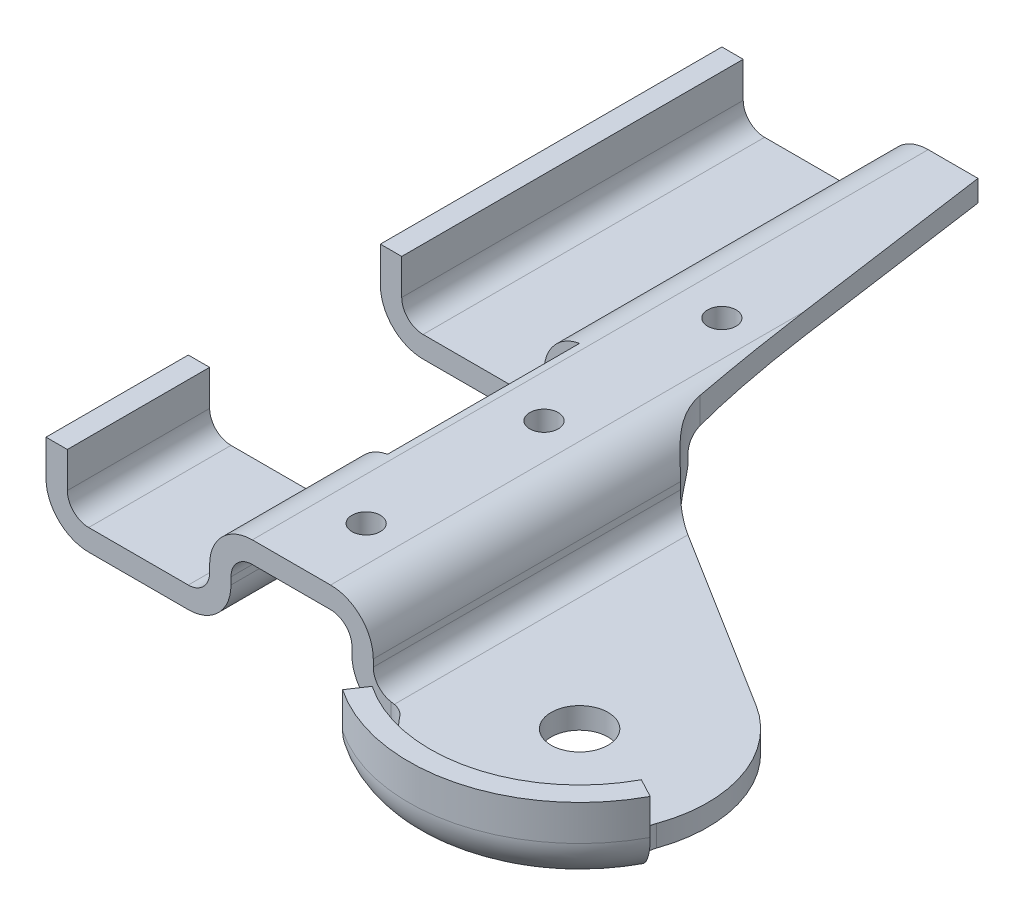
ISO-10303-21;
HEADER;
FILE_DESCRIPTION(('STEP AP214'),'2;1');
FILE_NAME('part.step','',(''),(''),'','','');
FILE_SCHEMA(('AUTOMOTIVE_DESIGN { 1 0 10303 214 1 1 1 1 }'));
ENDSEC;
DATA;
#1=APPLICATION_CONTEXT('core data for automotive mechanical design processes');
#2=APPLICATION_PROTOCOL_DEFINITION('international standard','automotive_design',2000,#1);
#3=PRODUCT_CONTEXT('',#1,'mechanical');
#4=PRODUCT('Part','Part','',(#3));
#5=PRODUCT_RELATED_PRODUCT_CATEGORY('part','',(#4));
#6=PRODUCT_DEFINITION_FORMATION('','',#4);
#7=PRODUCT_DEFINITION_CONTEXT('part definition',#1,'design');
#8=PRODUCT_DEFINITION('design','',#6,#7);
#9=PRODUCT_DEFINITION_SHAPE('','',#8);
#10=(LENGTH_UNIT() NAMED_UNIT(*) SI_UNIT(.MILLI.,.METRE.));
#11=(NAMED_UNIT(*) PLANE_ANGLE_UNIT() SI_UNIT($,.RADIAN.));
#12=(NAMED_UNIT(*) SI_UNIT($,.STERADIAN.) SOLID_ANGLE_UNIT());
#13=UNCERTAINTY_MEASURE_WITH_UNIT(LENGTH_MEASURE(1.E-05),#10,'distance_accuracy_value','');
#14=(GEOMETRIC_REPRESENTATION_CONTEXT(3) GLOBAL_UNCERTAINTY_ASSIGNED_CONTEXT((#13)) GLOBAL_UNIT_ASSIGNED_CONTEXT((#10,
#11,#12)) REPRESENTATION_CONTEXT('',''));
#15=CARTESIAN_POINT('',(0.,0.,0.));
#16=DIRECTION('',(0.,0.,1.));
#17=DIRECTION('',(1.,0.,0.));
#18=AXIS2_PLACEMENT_3D('',#15,#16,#17);
#19=CARTESIAN_POINT('',(-10.,-2.,109.));
#20=DIRECTION('',(0.,-1.,0.));
#21=DIRECTION('',(1.,0.,0.));
#22=AXIS2_PLACEMENT_3D('',#19,#20,#21);
#23=PLANE('',#22);
#24=DIRECTION('',(0.,0.,-1.));
#25=VECTOR('',#24,1.);
#26=CARTESIAN_POINT('',(-10.,-2.,109.));
#27=LINE('',#26,#25);
#28=CARTESIAN_POINT('',(-10.,-2.,95.));
#29=VERTEX_POINT('',#28);
#30=CARTESIAN_POINT('',(-10.,-2.,75.));
#31=VERTEX_POINT('',#30);
#32=EDGE_CURVE('E909',#29,#31,#27,.T.);
#33=ORIENTED_EDGE('',*,*,#32,.T.);
#34=DIRECTION('',(-1.,0.,0.));
#35=VECTOR('',#34,1.);
#36=CARTESIAN_POINT('',(-10.,-2.,75.));
#37=LINE('',#36,#35);
#38=CARTESIAN_POINT('',(-13.,-2.,75.));
#39=VERTEX_POINT('',#38);
#40=EDGE_CURVE('E1012',#31,#39,#37,.T.);
#41=ORIENTED_EDGE('',*,*,#40,.T.);
#42=DIRECTION('',(0.,0.,-1.));
#43=VECTOR('',#42,1.);
#44=CARTESIAN_POINT('',(-13.,-2.,109.));
#45=LINE('',#44,#43);
#46=CARTESIAN_POINT('',(-13.,-2.,95.));
#47=VERTEX_POINT('',#46);
#48=EDGE_CURVE('E705',#47,#39,#45,.T.);
#49=ORIENTED_EDGE('',*,*,#48,.F.);
#50=DIRECTION('',(-1.,0.,0.));
#51=VECTOR('',#50,1.);
#52=CARTESIAN_POINT('',(-10.,-2.,95.));
#53=LINE('',#52,#51);
#54=EDGE_CURVE('E1110',#29,#47,#53,.T.);
#55=ORIENTED_EDGE('',*,*,#54,.F.);
#56=EDGE_LOOP('',(#33,#41,#49,#55));
#57=FACE_BOUND('',#56,.T.);
#58=ADVANCED_FACE('F350',(#57),#23,.F.);
#59=CARTESIAN_POINT('',(-13.,-2.,109.));
#60=DIRECTION('',(1.,0.,0.));
#61=DIRECTION('',(0.,0.,-1.));
#62=AXIS2_PLACEMENT_3D('',#59,#60,#61);
#63=PLANE('',#62);
#64=ORIENTED_EDGE('',*,*,#48,.T.);
#65=DIRECTION('',(0.,-1.,0.));
#66=VECTOR('',#65,1.);
#67=CARTESIAN_POINT('',(-13.,-2.,75.));
#68=LINE('',#67,#66);
#69=CARTESIAN_POINT('',(-13.,-6.99999999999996,75.));
#70=VERTEX_POINT('',#69);
#71=EDGE_CURVE('E1015',#39,#70,#68,.T.);
#72=ORIENTED_EDGE('',*,*,#71,.T.);
#73=DIRECTION('',(0.,0.,-1.));
#74=VECTOR('',#73,1.);
#75=CARTESIAN_POINT('',(-13.,-6.99999999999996,109.));
#76=LINE('',#75,#74);
#77=CARTESIAN_POINT('',(-13.,-7.,95.));
#78=VERTEX_POINT('',#77);
#79=EDGE_CURVE('E701',#78,#70,#76,.T.);
#80=ORIENTED_EDGE('',*,*,#79,.F.);
#81=DIRECTION('',(0.,1.,0.));
#82=VECTOR('',#81,1.);
#83=CARTESIAN_POINT('',(-13.,-13.,95.));
#84=LINE('',#83,#82);
#85=EDGE_CURVE('E1063',#78,#47,#84,.T.);
#86=ORIENTED_EDGE('',*,*,#85,.T.);
#87=EDGE_LOOP('',(#64,#72,#80,#86));
#88=FACE_BOUND('',#87,.T.);
#89=ADVANCED_FACE('F838',(#88),#63,.F.);
#90=CARTESIAN_POINT('',(-7.,-7.,109.));
#91=DIRECTION('',(0.,0.,-1.));
#92=DIRECTION('',(-1.,0.,0.));
#93=AXIS2_PLACEMENT_3D('',#90,#91,#92);
#94=CYLINDRICAL_SURFACE('',#93,6.);
#95=ORIENTED_EDGE('',*,*,#79,.T.);
#96=CARTESIAN_POINT('',(-7.,-7.,75.));
#97=DIRECTION('',(0.,0.,1.));
#98=DIRECTION('',(1.,0.,0.));
#99=AXIS2_PLACEMENT_3D('',#96,#97,#98);
#100=CIRCLE('',#99,6.);
#101=CARTESIAN_POINT('',(-6.99999999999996,-13.,75.));
#102=VERTEX_POINT('',#101);
#103=EDGE_CURVE('E1018',#70,#102,#100,.T.);
#104=ORIENTED_EDGE('',*,*,#103,.T.);
#105=DIRECTION('',(0.,0.,-1.));
#106=VECTOR('',#105,1.);
#107=CARTESIAN_POINT('',(-6.99999999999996,-13.,109.));
#108=LINE('',#107,#106);
#109=CARTESIAN_POINT('',(-6.99999999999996,-13.,95.));
#110=VERTEX_POINT('',#109);
#111=EDGE_CURVE('E692',#110,#102,#108,.T.);
#112=ORIENTED_EDGE('',*,*,#111,.F.);
#113=CARTESIAN_POINT('',(-7.,-7.,95.));
#114=DIRECTION('',(0.,0.,1.));
#115=DIRECTION('',(1.,0.,0.));
#116=AXIS2_PLACEMENT_3D('',#113,#114,#115);
#117=CIRCLE('',#116,6.);
#118=EDGE_CURVE('E1132',#78,#110,#117,.T.);
#119=ORIENTED_EDGE('',*,*,#118,.F.);
#120=EDGE_LOOP('',(#95,#104,#112,#119));
#121=FACE_BOUND('',#120,.T.);
#122=ADVANCED_FACE('F843',(#121),#94,.T.);
#123=CARTESIAN_POINT('',(-6.99999999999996,-13.,109.));
#124=DIRECTION('',(0.,1.,0.));
#125=DIRECTION('',(0.,0.,1.));
#126=AXIS2_PLACEMENT_3D('',#123,#124,#125);
#127=PLANE('',#126);
#128=ORIENTED_EDGE('',*,*,#111,.T.);
#129=DIRECTION('',(-1.,0.,0.));
#130=VECTOR('',#129,1.);
#131=CARTESIAN_POINT('',(-19.,-13.,75.));
#132=LINE('',#131,#130);
#133=CARTESIAN_POINT('',(7.,-13.,75.));
#134=VERTEX_POINT('',#133);
#135=EDGE_CURVE('E685',#134,#102,#132,.T.);
#136=ORIENTED_EDGE('',*,*,#135,.F.);
#137=DIRECTION('',(0.,0.,-1.));
#138=VECTOR('',#137,1.);
#139=CARTESIAN_POINT('',(6.99999999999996,-13.,109.));
#140=LINE('',#139,#138);
#141=CARTESIAN_POINT('',(7.,-13.,95.));
#142=VERTEX_POINT('',#141);
#143=EDGE_CURVE('E693',#142,#134,#140,.T.);
#144=ORIENTED_EDGE('',*,*,#143,.F.);
#145=DIRECTION('',(1.,0.,0.));
#146=VECTOR('',#145,1.);
#147=CARTESIAN_POINT('',(-13.,-13.,95.));
#148=LINE('',#147,#146);
#149=EDGE_CURVE('E1051',#110,#142,#148,.T.);
#150=ORIENTED_EDGE('',*,*,#149,.F.);
#151=EDGE_LOOP('',(#128,#136,#144,#150));
#152=FACE_BOUND('',#151,.T.);
#153=ADVANCED_FACE('F1231',(#152),#127,.F.);
#154=CARTESIAN_POINT('',(7.,-7.,109.));
#155=DIRECTION('',(0.,0.,-1.));
#156=DIRECTION('',(-1.,0.,0.));
#157=AXIS2_PLACEMENT_3D('',#154,#155,#156);
#158=CYLINDRICAL_SURFACE('',#157,6.);
#159=ORIENTED_EDGE('',*,*,#143,.T.);
#160=CARTESIAN_POINT('',(7.,-7.,75.));
#161=DIRECTION('',(0.,0.,1.));
#162=DIRECTION('',(1.,0.,0.));
#163=AXIS2_PLACEMENT_3D('',#160,#161,#162);
#164=CIRCLE('',#163,6.);
#165=CARTESIAN_POINT('',(13.,-6.99999999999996,75.));
#166=VERTEX_POINT('',#165);
#167=EDGE_CURVE('E1025',#134,#166,#164,.T.);
#168=ORIENTED_EDGE('',*,*,#167,.T.);
#169=DIRECTION('',(0.,0.,-1.));
#170=VECTOR('',#169,1.);
#171=CARTESIAN_POINT('',(13.,-6.99999999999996,109.));
#172=LINE('',#171,#170);
#173=CARTESIAN_POINT('',(13.,-6.99999999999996,95.));
#174=VERTEX_POINT('',#173);
#175=EDGE_CURVE('E963',#174,#166,#172,.T.);
#176=ORIENTED_EDGE('',*,*,#175,.F.);
#177=CARTESIAN_POINT('',(7.,-7.,95.));
#178=DIRECTION('',(0.,0.,1.));
#179=DIRECTION('',(1.,0.,0.));
#180=AXIS2_PLACEMENT_3D('',#177,#178,#179);
#181=CIRCLE('',#180,6.);
#182=EDGE_CURVE('E1130',#142,#174,#181,.T.);
#183=ORIENTED_EDGE('',*,*,#182,.F.);
#184=EDGE_LOOP('',(#159,#168,#176,#183));
#185=FACE_BOUND('',#184,.T.);
#186=ADVANCED_FACE('F1234',(#185),#158,.T.);
#187=CARTESIAN_POINT('',(13.,-6.99999999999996,109.));
#188=DIRECTION('',(-1.,0.,0.));
#189=DIRECTION('',(0.,0.,1.));
#190=AXIS2_PLACEMENT_3D('',#187,#188,#189);
#191=PLANE('',#190);
#192=ORIENTED_EDGE('',*,*,#175,.T.);
#193=DIRECTION('',(0.,1.,0.));
#194=VECTOR('',#193,1.);
#195=CARTESIAN_POINT('',(13.,-6.99999999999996,75.));
#196=LINE('',#195,#194);
#197=CARTESIAN_POINT('',(13.,-6.00000000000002,75.));
#198=VERTEX_POINT('',#197);
#199=EDGE_CURVE('E1023',#166,#198,#196,.T.);
#200=ORIENTED_EDGE('',*,*,#199,.T.);
#201=DIRECTION('',(0.,0.,-1.));
#202=VECTOR('',#201,1.);
#203=CARTESIAN_POINT('',(13.,-6.00000000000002,109.));
#204=LINE('',#203,#202);
#205=CARTESIAN_POINT('',(13.,-6.00000000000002,95.));
#206=VERTEX_POINT('',#205);
#207=EDGE_CURVE('E960',#206,#198,#204,.T.);
#208=ORIENTED_EDGE('',*,*,#207,.F.);
#209=DIRECTION('',(0.,1.,0.));
#210=VECTOR('',#209,1.);
#211=CARTESIAN_POINT('',(13.,-6.99999999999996,95.));
#212=LINE('',#211,#210);
#213=EDGE_CURVE('E1128',#174,#206,#212,.T.);
#214=ORIENTED_EDGE('',*,*,#213,.F.);
#215=EDGE_LOOP('',(#192,#200,#208,#214));
#216=FACE_BOUND('',#215,.T.);
#217=ADVANCED_FACE('F1236',(#216),#191,.F.);
#218=CARTESIAN_POINT('',(10.,-6.99999999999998,109.));
#219=DIRECTION('',(1.,0.,0.));
#220=DIRECTION('',(0.,0.,-1.));
#221=AXIS2_PLACEMENT_3D('',#218,#219,#220);
#222=PLANE('',#221);
#223=DIRECTION('',(0.,0.,-1.));
#224=VECTOR('',#223,1.);
#225=CARTESIAN_POINT('',(10.,-6.00000000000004,109.));
#226=LINE('',#225,#224);
#227=CARTESIAN_POINT('',(10.,-6.00000000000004,95.));
#228=VERTEX_POINT('',#227);
#229=CARTESIAN_POINT('',(10.,-6.00000000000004,75.));
#230=VERTEX_POINT('',#229);
#231=EDGE_CURVE('E928',#228,#230,#226,.T.);
#232=ORIENTED_EDGE('',*,*,#231,.T.);
#233=DIRECTION('',(0.,-1.,0.));
#234=VECTOR('',#233,1.);
#235=CARTESIAN_POINT('',(10.,-6.99999999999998,75.));
#236=LINE('',#235,#234);
#237=CARTESIAN_POINT('',(10.,-7.,75.));
#238=VERTEX_POINT('',#237);
#239=EDGE_CURVE('E1006',#230,#238,#236,.T.);
#240=ORIENTED_EDGE('',*,*,#239,.T.);
#241=DIRECTION('',(0.,0.,-1.));
#242=VECTOR('',#241,1.);
#243=CARTESIAN_POINT('',(10.,-6.99999999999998,109.));
#244=LINE('',#243,#242);
#245=CARTESIAN_POINT('',(10.,-7.,95.));
#246=VERTEX_POINT('',#245);
#247=EDGE_CURVE('E924',#246,#238,#244,.T.);
#248=ORIENTED_EDGE('',*,*,#247,.F.);
#249=DIRECTION('',(0.,-1.,0.));
#250=VECTOR('',#249,1.);
#251=CARTESIAN_POINT('',(10.,-6.99999999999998,95.));
#252=LINE('',#251,#250);
#253=EDGE_CURVE('E1106',#228,#246,#252,.T.);
#254=ORIENTED_EDGE('',*,*,#253,.F.);
#255=EDGE_LOOP('',(#232,#240,#248,#254));
#256=FACE_BOUND('',#255,.T.);
#257=ADVANCED_FACE('F824',(#256),#222,.F.);
#258=CARTESIAN_POINT('',(7.,-7.,109.));
#259=DIRECTION('',(0.,0.,-1.));
#260=DIRECTION('',(-1.,0.,0.));
#261=AXIS2_PLACEMENT_3D('',#258,#259,#260);
#262=CYLINDRICAL_SURFACE('',#261,3.);
#263=ORIENTED_EDGE('',*,*,#247,.T.);
#264=CARTESIAN_POINT('',(7.,-7.,75.));
#265=DIRECTION('',(0.,0.,1.));
#266=DIRECTION('',(1.,0.,0.));
#267=AXIS2_PLACEMENT_3D('',#264,#265,#266);
#268=CIRCLE('',#267,3.);
#269=CARTESIAN_POINT('',(6.99999999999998,-10.,75.));
#270=VERTEX_POINT('',#269);
#271=EDGE_CURVE('E1003',#238,#270,#268,.F.);
#272=ORIENTED_EDGE('',*,*,#271,.T.);
#273=DIRECTION('',(0.,0.,-1.));
#274=VECTOR('',#273,1.);
#275=CARTESIAN_POINT('',(6.99999999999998,-10.,109.));
#276=LINE('',#275,#274);
#277=CARTESIAN_POINT('',(6.99999999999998,-10.,95.));
#278=VERTEX_POINT('',#277);
#279=EDGE_CURVE('E920',#278,#270,#276,.T.);
#280=ORIENTED_EDGE('',*,*,#279,.F.);
#281=CARTESIAN_POINT('',(7.,-7.,95.));
#282=DIRECTION('',(0.,0.,1.));
#283=DIRECTION('',(1.,0.,0.));
#284=AXIS2_PLACEMENT_3D('',#281,#282,#283);
#285=CIRCLE('',#284,3.);
#286=EDGE_CURVE('E1104',#246,#278,#285,.F.);
#287=ORIENTED_EDGE('',*,*,#286,.F.);
#288=EDGE_LOOP('',(#263,#272,#280,#287));
#289=FACE_BOUND('',#288,.T.);
#290=ADVANCED_FACE('F819',(#289),#262,.F.);
#291=CARTESIAN_POINT('',(6.99999999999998,-10.,109.));
#292=DIRECTION('',(0.,-1.,0.));
#293=DIRECTION('',(1.,0.,0.));
#294=AXIS2_PLACEMENT_3D('',#291,#292,#293);
#295=PLANE('',#294);
#296=ORIENTED_EDGE('',*,*,#279,.T.);
#297=DIRECTION('',(-1.,0.,0.));
#298=VECTOR('',#297,1.);
#299=CARTESIAN_POINT('',(6.99999999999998,-10.,75.));
#300=LINE('',#299,#298);
#301=CARTESIAN_POINT('',(-6.99999999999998,-10.,75.));
#302=VERTEX_POINT('',#301);
#303=EDGE_CURVE('E1000',#270,#302,#300,.T.);
#304=ORIENTED_EDGE('',*,*,#303,.T.);
#305=DIRECTION('',(0.,0.,-1.));
#306=VECTOR('',#305,1.);
#307=CARTESIAN_POINT('',(-6.99999999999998,-10.,109.));
#308=LINE('',#307,#306);
#309=CARTESIAN_POINT('',(-6.99999999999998,-10.,95.));
#310=VERTEX_POINT('',#309);
#311=EDGE_CURVE('E916',#310,#302,#308,.T.);
#312=ORIENTED_EDGE('',*,*,#311,.F.);
#313=DIRECTION('',(-1.,0.,0.));
#314=VECTOR('',#313,1.);
#315=CARTESIAN_POINT('',(6.99999999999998,-10.,95.));
#316=LINE('',#315,#314);
#317=EDGE_CURVE('E1102',#278,#310,#316,.T.);
#318=ORIENTED_EDGE('',*,*,#317,.F.);
#319=EDGE_LOOP('',(#296,#304,#312,#318));
#320=FACE_BOUND('',#319,.T.);
#321=ADVANCED_FACE('F814',(#320),#295,.F.);
#322=CARTESIAN_POINT('',(-7.,-7.,109.));
#323=DIRECTION('',(0.,0.,-1.));
#324=DIRECTION('',(-1.,0.,0.));
#325=AXIS2_PLACEMENT_3D('',#322,#323,#324);
#326=CYLINDRICAL_SURFACE('',#325,3.);
#327=ORIENTED_EDGE('',*,*,#311,.T.);
#328=CARTESIAN_POINT('',(-7.,-7.,75.));
#329=DIRECTION('',(0.,0.,1.));
#330=DIRECTION('',(1.,0.,0.));
#331=AXIS2_PLACEMENT_3D('',#328,#329,#330);
#332=CIRCLE('',#331,3.);
#333=CARTESIAN_POINT('',(-10.,-6.99999999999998,75.));
#334=VERTEX_POINT('',#333);
#335=EDGE_CURVE('E997',#302,#334,#332,.F.);
#336=ORIENTED_EDGE('',*,*,#335,.T.);
#337=DIRECTION('',(0.,0.,-1.));
#338=VECTOR('',#337,1.);
#339=CARTESIAN_POINT('',(-10.,-6.99999999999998,109.));
#340=LINE('',#339,#338);
#341=CARTESIAN_POINT('',(-10.,-6.99999999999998,95.));
#342=VERTEX_POINT('',#341);
#343=EDGE_CURVE('E912',#342,#334,#340,.T.);
#344=ORIENTED_EDGE('',*,*,#343,.F.);
#345=CARTESIAN_POINT('',(-7.,-7.,95.));
#346=DIRECTION('',(0.,0.,1.));
#347=DIRECTION('',(1.,0.,0.));
#348=AXIS2_PLACEMENT_3D('',#345,#346,#347);
#349=CIRCLE('',#348,3.);
#350=EDGE_CURVE('E1100',#310,#342,#349,.F.);
#351=ORIENTED_EDGE('',*,*,#350,.F.);
#352=EDGE_LOOP('',(#327,#336,#344,#351));
#353=FACE_BOUND('',#352,.T.);
#354=ADVANCED_FACE('F809',(#353),#326,.F.);
#355=CARTESIAN_POINT('',(-10.,-6.99999999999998,109.));
#356=DIRECTION('',(-1.,0.,0.));
#357=DIRECTION('',(0.,-1.,0.));
#358=AXIS2_PLACEMENT_3D('',#355,#356,#357);
#359=PLANE('',#358);
#360=ORIENTED_EDGE('',*,*,#343,.T.);
#361=DIRECTION('',(0.,1.,0.));
#362=VECTOR('',#361,1.);
#363=CARTESIAN_POINT('',(-10.,-6.99999999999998,75.));
#364=LINE('',#363,#362);
#365=EDGE_CURVE('E359',#334,#31,#364,.T.);
#366=ORIENTED_EDGE('',*,*,#365,.T.);
#367=ORIENTED_EDGE('',*,*,#32,.F.);
#368=DIRECTION('',(0.,1.,0.));
#369=VECTOR('',#368,1.);
#370=CARTESIAN_POINT('',(-10.,-6.99999999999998,95.));
#371=LINE('',#370,#369);
#372=EDGE_CURVE('E711',#342,#29,#371,.T.);
#373=ORIENTED_EDGE('',*,*,#372,.F.);
#374=EDGE_LOOP('',(#360,#366,#367,#373));
#375=FACE_BOUND('',#374,.T.);
#376=ADVANCED_FACE('F804',(#375),#359,.F.);
#377=CARTESIAN_POINT('',(36.,-9.99999999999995,109.));
#378=DIRECTION('',(0.,-1.,0.));
#379=DIRECTION('',(1.,0.,0.));
#380=AXIS2_PLACEMENT_3D('',#377,#378,#379);
#381=PLANE('',#380);
#382=CARTESIAN_POINT('',(52.,-9.99999999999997,85.));
#383=DIRECTION('',(0.,-1.,0.));
#384=DIRECTION('',(1.,0.,0.));
#385=AXIS2_PLACEMENT_3D('',#382,#383,#384);
#386=CIRCLE('',#385,4.);
#387=CARTESIAN_POINT('',(56.,-9.99999999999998,85.));
#388=VERTEX_POINT('',#387);
#389=EDGE_CURVE('E1381',#388,#388,#386,.T.);
#390=ORIENTED_EDGE('',*,*,#389,.T.);
#391=EDGE_LOOP('',(#390));
#392=FACE_BOUND('',#391,.T.);
#393=CARTESIAN_POINT('',(52.,-9.99999999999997,85.));
#394=DIRECTION('',(0.,-1.,0.));
#395=DIRECTION('',(1.,0.,0.));
#396=AXIS2_PLACEMENT_3D('',#393,#394,#395);
#397=CIRCLE('',#396,18.);
#398=CARTESIAN_POINT('',(39.9059551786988,-10.,98.331694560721));
#399=VERTEX_POINT('',#398);
#400=CARTESIAN_POINT('',(37.8636378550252,-9.99999999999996,96.1428571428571));
#401=VERTEX_POINT('',#400);
#402=EDGE_CURVE('E1148',#399,#401,#397,.T.);
#403=ORIENTED_EDGE('',*,*,#402,.F.);
#404=CARTESIAN_POINT('',(52.,-9.99999999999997,85.));
#405=DIRECTION('',(0.,-1.,0.));
#406=DIRECTION('',(1.,0.,0.));
#407=AXIS2_PLACEMENT_3D('',#404,#405,#406);
#408=CIRCLE('',#407,18.);
#409=CARTESIAN_POINT('',(68.9372592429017,-10.,91.0933774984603));
#410=VERTEX_POINT('',#409);
#411=EDGE_CURVE('E1274',#399,#410,#408,.F.);
#412=ORIENTED_EDGE('',*,*,#411,.T.);
#413=CARTESIAN_POINT('',(52.,-9.99999999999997,85.));
#414=DIRECTION('',(0.,-1.,0.));
#415=DIRECTION('',(1.,0.,0.));
#416=AXIS2_PLACEMENT_3D('',#413,#414,#415);
#417=CIRCLE('',#416,18.);
#418=CARTESIAN_POINT('',(61.5385467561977,-10.,69.7351342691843));
#419=VERTEX_POINT('',#418);
#420=EDGE_CURVE('E1149',#419,#410,#417,.T.);
#421=ORIENTED_EDGE('',*,*,#420,.F.);
#422=DIRECTION('',(0.848048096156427,0.,0.529919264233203));
#423=VECTOR('',#422,1.);
#424=CARTESIAN_POINT('',(60.817106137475,-9.99999999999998,69.284328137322));
#425=LINE('',#424,#423);
#426=CARTESIAN_POINT('',(36.,-9.99999999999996,53.7768791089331));
#427=VERTEX_POINT('',#426);
#428=EDGE_CURVE('E779',#427,#419,#425,.T.);
#429=ORIENTED_EDGE('',*,*,#428,.F.);
#430=DIRECTION('',(0.,0.,-1.));
#431=VECTOR('',#430,1.);
#432=CARTESIAN_POINT('',(36.,-9.99999999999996,109.));
#433=LINE('',#432,#431);
#434=CARTESIAN_POINT('',(36.,-9.99999999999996,95.0406892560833));
#435=VERTEX_POINT('',#434);
#436=EDGE_CURVE('E942',#435,#427,#433,.T.);
#437=ORIENTED_EDGE('',*,*,#436,.F.);
#438=CARTESIAN_POINT('',(35.5075774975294,-9.99999999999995,98.));
#439=DIRECTION('',(0.,-1.,0.));
#440=DIRECTION('',(1.,0.,0.));
#441=AXIS2_PLACEMENT_3D('',#438,#439,#440);
#442=CIRCLE('',#441,3.);
#443=EDGE_CURVE('E780',#401,#435,#442,.F.);
#444=ORIENTED_EDGE('',*,*,#443,.F.);
#445=EDGE_LOOP('',(#403,#412,#421,#429,#437,#444));
#446=FACE_BOUND('',#445,.T.);
#447=ADVANCED_FACE('F848',(#392,#446),#381,.F.);
#448=CARTESIAN_POINT('',(-13.,-2.,48.));
#449=VERTEX_POINT('',#448);
#450=CARTESIAN_POINT('',(-13.,-2.,0.));
#451=VERTEX_POINT('',#450);
#452=EDGE_CURVE('E704',#449,#451,#45,.T.);
#453=ORIENTED_EDGE('',*,*,#452,.F.);
#454=DIRECTION('',(1.,0.,0.));
#455=VECTOR('',#454,1.);
#456=CARTESIAN_POINT('',(-9.99999999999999,-2.,48.));
#457=LINE('',#456,#455);
#458=CARTESIAN_POINT('',(-10.,-2.,48.));
#459=VERTEX_POINT('',#458);
#460=EDGE_CURVE('E859',#449,#459,#457,.T.);
#461=ORIENTED_EDGE('',*,*,#460,.T.);
#462=CARTESIAN_POINT('',(-10.,-2.,0.));
#463=VERTEX_POINT('',#462);
#464=EDGE_CURVE('E908',#459,#463,#27,.T.);
#465=ORIENTED_EDGE('',*,*,#464,.T.);
#466=DIRECTION('',(-1.,0.,0.));
#467=VECTOR('',#466,1.);
#468=CARTESIAN_POINT('',(-10.,-2.,0.));
#469=LINE('',#468,#467);
#470=EDGE_CURVE('E862',#463,#451,#469,.T.);
#471=ORIENTED_EDGE('',*,*,#470,.T.);
#472=EDGE_LOOP('',(#453,#461,#465,#471));
#473=FACE_BOUND('',#472,.T.);
#474=ADVANCED_FACE('F352',(#473),#23,.F.);
#475=CARTESIAN_POINT('',(-13.,-6.99999999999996,48.));
#476=VERTEX_POINT('',#475);
#477=CARTESIAN_POINT('',(-13.,-6.99999999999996,0.));
#478=VERTEX_POINT('',#477);
#479=EDGE_CURVE('E696',#476,#478,#76,.T.);
#480=ORIENTED_EDGE('',*,*,#479,.F.);
#481=DIRECTION('',(0.,1.,0.));
#482=VECTOR('',#481,1.);
#483=CARTESIAN_POINT('',(-13.,-2.,48.));
#484=LINE('',#483,#482);
#485=EDGE_CURVE('E672',#476,#449,#484,.T.);
#486=ORIENTED_EDGE('',*,*,#485,.T.);
#487=ORIENTED_EDGE('',*,*,#452,.T.);
#488=DIRECTION('',(0.,-1.,0.));
#489=VECTOR('',#488,1.);
#490=CARTESIAN_POINT('',(-13.,-2.,0.));
#491=LINE('',#490,#489);
#492=EDGE_CURVE('E865',#451,#478,#491,.T.);
#493=ORIENTED_EDGE('',*,*,#492,.T.);
#494=EDGE_LOOP('',(#480,#486,#487,#493));
#495=FACE_BOUND('',#494,.T.);
#496=ADVANCED_FACE('F845',(#495),#63,.F.);
#497=CARTESIAN_POINT('',(-6.99999999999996,-13.,48.));
#498=VERTEX_POINT('',#497);
#499=CARTESIAN_POINT('',(-6.99999999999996,-13.,0.));
#500=VERTEX_POINT('',#499);
#501=EDGE_CURVE('E682',#498,#500,#108,.T.);
#502=ORIENTED_EDGE('',*,*,#501,.F.);
#503=CARTESIAN_POINT('',(-7.,-7.,48.));
#504=DIRECTION('',(0.,0.,-1.));
#505=DIRECTION('',(-1.,0.,0.));
#506=AXIS2_PLACEMENT_3D('',#503,#504,#505);
#507=CIRCLE('',#506,6.);
#508=EDGE_CURVE('E666',#498,#476,#507,.T.);
#509=ORIENTED_EDGE('',*,*,#508,.T.);
#510=ORIENTED_EDGE('',*,*,#479,.T.);
#511=CARTESIAN_POINT('',(-7.,-7.,0.));
#512=DIRECTION('',(0.,0.,1.));
#513=DIRECTION('',(-1.,0.,0.));
#514=AXIS2_PLACEMENT_3D('',#511,#512,#513);
#515=CIRCLE('',#514,6.);
#516=EDGE_CURVE('E690',#478,#500,#515,.T.);
#517=ORIENTED_EDGE('',*,*,#516,.T.);
#518=EDGE_LOOP('',(#502,#509,#510,#517));
#519=FACE_BOUND('',#518,.T.);
#520=ADVANCED_FACE('F688',(#519),#94,.T.);
#521=CARTESIAN_POINT('',(7.,-13.,48.));
#522=VERTEX_POINT('',#521);
#523=CARTESIAN_POINT('',(6.99999999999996,-13.,0.));
#524=VERTEX_POINT('',#523);
#525=EDGE_CURVE('E684',#522,#524,#140,.T.);
#526=ORIENTED_EDGE('',*,*,#525,.F.);
#527=DIRECTION('',(1.,0.,0.));
#528=VECTOR('',#527,1.);
#529=CARTESIAN_POINT('',(-19.,-13.,48.));
#530=LINE('',#529,#528);
#531=EDGE_CURVE('E669',#498,#522,#530,.T.);
#532=ORIENTED_EDGE('',*,*,#531,.F.);
#533=ORIENTED_EDGE('',*,*,#501,.T.);
#534=DIRECTION('',(1.,0.,0.));
#535=VECTOR('',#534,1.);
#536=CARTESIAN_POINT('',(-6.99999999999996,-13.,0.));
#537=LINE('',#536,#535);
#538=EDGE_CURVE('E869',#500,#524,#537,.T.);
#539=ORIENTED_EDGE('',*,*,#538,.T.);
#540=EDGE_LOOP('',(#526,#532,#533,#539));
#541=FACE_BOUND('',#540,.T.);
#542=ADVANCED_FACE('F680',(#541),#127,.F.);
#543=CARTESIAN_POINT('',(13.,-6.99999999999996,48.));
#544=VERTEX_POINT('',#543);
#545=CARTESIAN_POINT('',(13.,-6.99999999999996,0.));
#546=VERTEX_POINT('',#545);
#547=EDGE_CURVE('E962',#544,#546,#172,.T.);
#548=ORIENTED_EDGE('',*,*,#547,.F.);
#549=CARTESIAN_POINT('',(7.,-7.,48.));
#550=DIRECTION('',(0.,0.,-1.));
#551=DIRECTION('',(-1.,0.,0.));
#552=AXIS2_PLACEMENT_3D('',#549,#550,#551);
#553=CIRCLE('',#552,6.);
#554=EDGE_CURVE('E992',#544,#522,#553,.T.);
#555=ORIENTED_EDGE('',*,*,#554,.T.);
#556=ORIENTED_EDGE('',*,*,#525,.T.);
#557=CARTESIAN_POINT('',(7.,-7.,0.));
#558=DIRECTION('',(0.,0.,1.));
#559=DIRECTION('',(-1.,0.,0.));
#560=AXIS2_PLACEMENT_3D('',#557,#558,#559);
#561=CIRCLE('',#560,6.);
#562=EDGE_CURVE('E875',#524,#546,#561,.T.);
#563=ORIENTED_EDGE('',*,*,#562,.T.);
#564=EDGE_LOOP('',(#548,#555,#556,#563));
#565=FACE_BOUND('',#564,.T.);
#566=ADVANCED_FACE('F979',(#565),#158,.T.);
#567=CARTESIAN_POINT('',(13.,-6.,48.));
#568=VERTEX_POINT('',#567);
#569=CARTESIAN_POINT('',(13.,-6.00000000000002,0.));
#570=VERTEX_POINT('',#569);
#571=EDGE_CURVE('E959',#568,#570,#204,.T.);
#572=ORIENTED_EDGE('',*,*,#571,.F.);
#573=DIRECTION('',(0.,-1.,0.));
#574=VECTOR('',#573,1.);
#575=CARTESIAN_POINT('',(13.,-6.99999999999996,48.));
#576=LINE('',#575,#574);
#577=EDGE_CURVE('E976',#568,#544,#576,.T.);
#578=ORIENTED_EDGE('',*,*,#577,.T.);
#579=ORIENTED_EDGE('',*,*,#547,.T.);
#580=DIRECTION('',(0.,1.,0.));
#581=VECTOR('',#580,1.);
#582=CARTESIAN_POINT('',(13.,-6.99999999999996,0.));
#583=LINE('',#582,#581);
#584=EDGE_CURVE('E878',#546,#570,#583,.T.);
#585=ORIENTED_EDGE('',*,*,#584,.T.);
#586=EDGE_LOOP('',(#572,#578,#579,#585));
#587=FACE_BOUND('',#586,.T.);
#588=ADVANCED_FACE('F973',(#587),#191,.F.);
#589=CARTESIAN_POINT('',(16.,-6.,109.));
#590=DIRECTION('',(0.,0.,-1.));
#591=DIRECTION('',(-1.,0.,0.));
#592=AXIS2_PLACEMENT_3D('',#589,#590,#591);
#593=CYLINDRICAL_SURFACE('',#592,3.);
#594=ORIENTED_EDGE('',*,*,#207,.T.);
#595=CARTESIAN_POINT('',(16.,-6.,75.));
#596=DIRECTION('',(0.,0.,1.));
#597=DIRECTION('',(1.,0.,0.));
#598=AXIS2_PLACEMENT_3D('',#595,#596,#597);
#599=CIRCLE('',#598,3.);
#600=CARTESIAN_POINT('',(15.,-3.17157287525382,75.));
#601=VERTEX_POINT('',#600);
#602=EDGE_CURVE('E1021',#198,#601,#599,.F.);
#603=ORIENTED_EDGE('',*,*,#602,.T.);
#604=DIRECTION('',(0.,0.,-1.));
#605=VECTOR('',#604,1.);
#606=CARTESIAN_POINT('',(15.,-3.17157287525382,109.));
#607=LINE('',#606,#605);
#608=CARTESIAN_POINT('',(15.,-3.17157287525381,48.));
#609=VERTEX_POINT('',#608);
#610=EDGE_CURVE('E988',#601,#609,#607,.T.);
#611=ORIENTED_EDGE('',*,*,#610,.T.);
#612=CARTESIAN_POINT('',(16.,-6.,48.));
#613=DIRECTION('',(0.,0.,-1.));
#614=DIRECTION('',(-1.,0.,0.));
#615=AXIS2_PLACEMENT_3D('',#612,#613,#614);
#616=CIRCLE('',#615,3.);
#617=EDGE_CURVE('E676',#609,#568,#616,.F.);
#618=ORIENTED_EDGE('',*,*,#617,.T.);
#619=ORIENTED_EDGE('',*,*,#571,.T.);
#620=CARTESIAN_POINT('',(16.,-6.,0.));
#621=DIRECTION('',(0.,0.,-1.));
#622=DIRECTION('',(-1.,0.,0.));
#623=AXIS2_PLACEMENT_3D('',#620,#621,#622);
#624=CIRCLE('',#623,3.);
#625=CARTESIAN_POINT('',(16.,-3.,0.));
#626=VERTEX_POINT('',#625);
#627=EDGE_CURVE('E881',#570,#626,#624,.T.);
#628=ORIENTED_EDGE('',*,*,#627,.T.);
#629=DIRECTION('',(0.,0.,-1.));
#630=VECTOR('',#629,1.);
#631=CARTESIAN_POINT('',(16.,-3.,109.));
#632=LINE('',#631,#630);
#633=CARTESIAN_POINT('',(16.,-3.,95.));
#634=VERTEX_POINT('',#633);
#635=EDGE_CURVE('E957',#634,#626,#632,.T.);
#636=ORIENTED_EDGE('',*,*,#635,.F.);
#637=CARTESIAN_POINT('',(16.,-6.,95.));
#638=DIRECTION('',(0.,0.,1.));
#639=DIRECTION('',(1.,0.,0.));
#640=AXIS2_PLACEMENT_3D('',#637,#638,#639);
#641=CIRCLE('',#640,3.);
#642=EDGE_CURVE('E1126',#206,#634,#641,.F.);
#643=ORIENTED_EDGE('',*,*,#642,.F.);
#644=EDGE_LOOP('',(#594,#603,#611,#618,#619,#628,#636,#643));
#645=FACE_BOUND('',#644,.T.);
#646=ADVANCED_FACE('F983',(#645),#593,.F.);
#647=CARTESIAN_POINT('',(16.,-3.,109.));
#648=DIRECTION('',(0.,1.,0.));
#649=DIRECTION('',(0.,0.,1.));
#650=AXIS2_PLACEMENT_3D('',#647,#648,#649);
#651=PLANE('',#650);
#652=CARTESIAN_POINT('',(22.,-3.,35.));
#653=DIRECTION('',(0.,1.,0.));
#654=DIRECTION('',(0.,0.,1.));
#655=AXIS2_PLACEMENT_3D('',#652,#653,#654);
#656=CIRCLE('',#655,2.);
#657=CARTESIAN_POINT('',(22.,-3.,37.));
#658=VERTEX_POINT('',#657);
#659=EDGE_CURVE('E1375',#658,#658,#656,.T.);
#660=ORIENTED_EDGE('',*,*,#659,.T.);
#661=EDGE_LOOP('',(#660));
#662=FACE_BOUND('',#661,.T.);
#663=CARTESIAN_POINT('',(22.,-3.,60.));
#664=DIRECTION('',(0.,1.,0.));
#665=DIRECTION('',(0.,0.,1.));
#666=AXIS2_PLACEMENT_3D('',#663,#664,#665);
#667=CIRCLE('',#666,2.);
#668=CARTESIAN_POINT('',(22.,-3.,62.));
#669=VERTEX_POINT('',#668);
#670=EDGE_CURVE('E1369',#669,#669,#667,.T.);
#671=ORIENTED_EDGE('',*,*,#670,.T.);
#672=EDGE_LOOP('',(#671));
#673=FACE_BOUND('',#672,.T.);
#674=CARTESIAN_POINT('',(22.,-3.,85.));
#675=DIRECTION('',(0.,1.,0.));
#676=DIRECTION('',(0.,0.,1.));
#677=AXIS2_PLACEMENT_3D('',#674,#675,#676);
#678=CIRCLE('',#677,2.);
#679=CARTESIAN_POINT('',(22.,-3.,87.));
#680=VERTEX_POINT('',#679);
#681=EDGE_CURVE('E686',#680,#680,#678,.T.);
#682=ORIENTED_EDGE('',*,*,#681,.T.);
#683=EDGE_LOOP('',(#682));
#684=FACE_BOUND('',#683,.T.);
#685=DIRECTION('',(-0.139173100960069,0.,-0.99026806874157));
#686=VECTOR('',#685,1.);
#687=CARTESIAN_POINT('',(37.8866518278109,-3.,105.924031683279));
#688=LINE('',#687,#686);
#689=CARTESIAN_POINT('',(27.,-3.,28.461478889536));
#690=VERTEX_POINT('',#689);
#691=CARTESIAN_POINT('',(23.,-3.,0.));
#692=VERTEX_POINT('',#691);
#693=EDGE_CURVE('E1098',#690,#692,#688,.T.);
#694=ORIENTED_EDGE('',*,*,#693,.F.);
#695=DIRECTION('',(0.,0.,-1.));
#696=VECTOR('',#695,1.);
#697=CARTESIAN_POINT('',(27.,-3.,109.));
#698=LINE('',#697,#696);
#699=CARTESIAN_POINT('',(27.,-3.,95.));
#700=VERTEX_POINT('',#699);
#701=EDGE_CURVE('E954',#700,#690,#698,.T.);
#702=ORIENTED_EDGE('',*,*,#701,.F.);
#703=DIRECTION('',(1.,0.,0.));
#704=VECTOR('',#703,1.);
#705=CARTESIAN_POINT('',(16.,-3.,95.));
#706=LINE('',#705,#704);
#707=EDGE_CURVE('E1124',#634,#700,#706,.T.);
#708=ORIENTED_EDGE('',*,*,#707,.F.);
#709=ORIENTED_EDGE('',*,*,#635,.T.);
#710=DIRECTION('',(1.,0.,0.));
#711=VECTOR('',#710,1.);
#712=CARTESIAN_POINT('',(16.,-3.,0.));
#713=LINE('',#712,#711);
#714=EDGE_CURVE('E884',#626,#692,#713,.T.);
#715=ORIENTED_EDGE('',*,*,#714,.T.);
#716=EDGE_LOOP('',(#694,#702,#708,#709,#715));
#717=FACE_BOUND('',#716,.T.);
#718=ADVANCED_FACE('F1242',(#662,#673,#684,#717),#651,.F.);
#719=CARTESIAN_POINT('',(27.,-6.,109.));
#720=DIRECTION('',(0.,0.,-1.));
#721=DIRECTION('',(-1.,0.,0.));
#722=AXIS2_PLACEMENT_3D('',#719,#720,#721);
#723=CYLINDRICAL_SURFACE('',#722,3.);
#724=CARTESIAN_POINT('',(27.,-6.,28.4614788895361));
#725=DIRECTION('',(0.99026806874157,0.,-0.139173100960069));
#726=DIRECTION('',(-0.139173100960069,0.,-0.99026806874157));
#727=AXIS2_PLACEMENT_3D('',#724,#725,#726);
#728=ELLIPSE('',#727,21.5558896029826,3.);
#729=CARTESIAN_POINT('',(29.3849324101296,-4.18008313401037,45.4311547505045));
#730=VERTEX_POINT('',#729);
#731=EDGE_CURVE('E1096',#730,#690,#728,.F.);
#732=ORIENTED_EDGE('',*,*,#731,.F.);
#733=CARTESIAN_POINT('',(30.,-6.00000000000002,47.7462071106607));
#734=CARTESIAN_POINT('',(30.0000034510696,-5.96640945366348,47.7462126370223));
#735=CARTESIAN_POINT('',(29.9994352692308,-5.93283777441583,47.7447924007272));
#736=CARTESIAN_POINT('',(29.9971912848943,-5.86599071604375,47.7391638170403));
#737=CARTESIAN_POINT('',(29.9955163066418,-5.83271513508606,47.7349575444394));
#738=CARTESIAN_POINT('',(29.988922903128,-5.73423679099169,47.718351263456));
#739=CARTESIAN_POINT('',(29.9824346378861,-5.66977232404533,47.7019612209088));
#740=CARTESIAN_POINT('',(29.9659326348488,-5.54478084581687,47.6597515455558));
#741=CARTESIAN_POINT('',(29.9559282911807,-5.48424384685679,47.6339570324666));
#742=CARTESIAN_POINT('',(29.933206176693,-5.36767286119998,47.5744048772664));
#743=CARTESIAN_POINT('',(29.9204825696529,-5.31164892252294,47.5406300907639));
#744=CARTESIAN_POINT('',(29.8852610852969,-5.173633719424,47.4452439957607));
#745=CARTESIAN_POINT('',(29.8613621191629,-5.09533183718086,47.3788215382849));
#746=CARTESIAN_POINT('',(29.811539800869,-4.95065077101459,47.2347131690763));
#747=CARTESIAN_POINT('',(29.7856115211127,-4.88430198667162,47.1569994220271));
#748=CARTESIAN_POINT('',(29.7385455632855,-4.77393489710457,47.009295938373));
#749=CARTESIAN_POINT('',(29.7174348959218,-4.72806968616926,46.9406493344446));
#750=CARTESIAN_POINT('',(29.6757469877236,-4.64255982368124,46.799397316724));
#751=CARTESIAN_POINT('',(29.655170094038,-4.60291913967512,46.7267894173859));
#752=CARTESIAN_POINT('',(29.6150121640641,-4.52912357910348,46.5784601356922));
#753=CARTESIAN_POINT('',(29.595432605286,-4.49497668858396,46.5027344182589));
#754=CARTESIAN_POINT('',(29.5576313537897,-4.43159984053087,46.3489124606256));
#755=CARTESIAN_POINT('',(29.5394101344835,-4.40237159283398,46.2708154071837));
#756=CARTESIAN_POINT('',(29.4923983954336,-4.32938292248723,46.0575024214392));
#757=CARTESIAN_POINT('',(29.4651260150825,-4.28975106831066,45.9205297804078));
#758=CARTESIAN_POINT('',(29.4160123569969,-4.22105300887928,45.6429848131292));
#759=CARTESIAN_POINT('',(29.3941747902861,-4.19199401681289,45.502410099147));
#760=CARTESIAN_POINT('',(29.3563589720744,-4.14297815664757,45.2187034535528));
#761=CARTESIAN_POINT('',(29.3403895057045,-4.12303492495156,45.0755680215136));
#762=CARTESIAN_POINT('',(29.3146169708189,-4.09134561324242,44.7878932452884));
#763=CARTESIAN_POINT('',(29.3048124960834,-4.07959766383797,44.6433542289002));
#764=CARTESIAN_POINT('',(29.2910999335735,-4.06325449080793,44.3449413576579));
#765=CARTESIAN_POINT('',(29.2875777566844,-4.05912688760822,44.1910241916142));
#766=CARTESIAN_POINT('',(29.287648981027,-4.05921105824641,43.88316433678));
#767=CARTESIAN_POINT('',(29.2912437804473,-4.06342447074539,43.7292216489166));
#768=CARTESIAN_POINT('',(29.3054902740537,-4.08040696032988,43.4223438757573));
#769=CARTESIAN_POINT('',(29.3161323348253,-4.09316435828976,43.2694077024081));
#770=CARTESIAN_POINT('',(29.3443012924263,-4.12789949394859,42.9652497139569));
#771=CARTESIAN_POINT('',(29.3618255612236,-4.14987371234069,42.8140272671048));
#772=CARTESIAN_POINT('',(29.3961492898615,-4.19474266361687,42.5667964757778));
#773=CARTESIAN_POINT('',(29.4110593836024,-4.21462856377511,42.4699718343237));
#774=CARTESIAN_POINT('',(29.4435009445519,-4.25929088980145,42.2779091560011));
#775=CARTESIAN_POINT('',(29.4610318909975,-4.28406634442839,42.1826708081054));
#776=CARTESIAN_POINT('',(29.4985004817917,-4.33909509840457,41.9943109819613));
#777=CARTESIAN_POINT('',(29.518436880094,-4.36934556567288,41.9011884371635));
#778=CARTESIAN_POINT('',(29.5604080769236,-4.43607560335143,41.7177130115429));
#779=CARTESIAN_POINT('',(29.5824421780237,-4.47255310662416,41.6273592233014));
#780=CARTESIAN_POINT('',(29.6367884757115,-4.56772532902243,41.4169480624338));
#781=CARTESIAN_POINT('',(29.6698506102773,-4.62961706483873,41.2984931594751));
#782=CARTESIAN_POINT('',(29.7372895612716,-4.7698377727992,41.0720727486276));
#783=CARTESIAN_POINT('',(29.77166382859,-4.84813608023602,40.964088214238));
#784=CARTESIAN_POINT('',(29.827008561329,-4.99410214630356,40.7987758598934));
#785=CARTESIAN_POINT('',(29.8485365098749,-5.05622173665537,40.7367676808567));
#786=CARTESIAN_POINT('',(29.8893052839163,-5.18959138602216,40.6224853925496));
#787=CARTESIAN_POINT('',(29.9085489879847,-5.26082971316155,40.5701989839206));
#788=CARTESIAN_POINT('',(29.9392779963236,-5.39634231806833,40.4883482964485));
#789=CARTESIAN_POINT('',(29.9515439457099,-5.45893946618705,40.4563182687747));
#790=CARTESIAN_POINT('',(29.972418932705,-5.58887151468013,40.4023923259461));
#791=CARTESIAN_POINT('',(29.9810367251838,-5.65619461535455,40.38047213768));
#792=CARTESIAN_POINT('',(29.9915031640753,-5.76991670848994,40.353983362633));
#793=CARTESIAN_POINT('',(29.9946644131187,-5.81542417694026,40.3460294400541));
#794=CARTESIAN_POINT('',(29.9989240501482,-5.90727185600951,40.3353361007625));
#795=CARTESIAN_POINT('',(30.0000164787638,-5.95361408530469,40.3326117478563));
#796=CARTESIAN_POINT('',(30.,-6.00000000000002,40.3326403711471));
#797=B_SPLINE_CURVE_WITH_KNOTS('',3,(#733,#734,#735,#736,#737,#738,#739,#740,#741,#742,#743,
#744,#745,#746,#747,#748,#749,#750,#751,#752,#753,#754,#755,#756,#757,#758,#759,#760,#761,#762,
#763,#764,#765,#766,#767,#768,#769,#770,#771,#772,#773,#774,#775,#776,#777,#778,#779,#780,#781,
#782,#783,#784,#785,#786,#787,#788,#789,#790,#791,#792,#793,#794,#795,#796),.UNSPECIFIED.,.F.,
.F.,(4,2,2,2,2,2,2,2,2,2,2,2,2,2,2,2,2,2,2,2,2,2,2,2,2,2,2,2,2,2,2,4),(0.,0.100701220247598,
0.201327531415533,0.400775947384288,0.599695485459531,0.799046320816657,1.11352833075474,
1.42879918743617,1.68409305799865,1.93954899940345,2.19537299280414,2.4512857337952,
2.88613597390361,3.3212823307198,3.75707751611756,4.19277326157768,4.6544154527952,
5.11614834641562,5.57725136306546,6.03817847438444,6.33792787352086,6.63761779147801,
6.9371531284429,7.23658922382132,7.64859105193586,8.05982958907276,8.33017828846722,
8.60018259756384,8.81350988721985,9.02632228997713,9.16491203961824,9.30390040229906),.UNSPECIFIED.);
#798=CARTESIAN_POINT('',(30.,-6.00000000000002,47.7462071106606));
#799=VERTEX_POINT('',#798);
#800=EDGE_CURVE('E1553',#799,#730,#797,.T.);
#801=ORIENTED_EDGE('',*,*,#800,.F.);
#802=DIRECTION('',(0.,0.,-1.));
#803=VECTOR('',#802,1.);
#804=CARTESIAN_POINT('',(30.,-6.00000000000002,109.));
#805=LINE('',#804,#803);
#806=CARTESIAN_POINT('',(30.,-6.00000000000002,95.));
#807=VERTEX_POINT('',#806);
#808=EDGE_CURVE('E951',#807,#799,#805,.T.);
#809=ORIENTED_EDGE('',*,*,#808,.F.);
#810=CARTESIAN_POINT('',(27.,-6.,95.));
#811=DIRECTION('',(0.,0.,1.));
#812=DIRECTION('',(1.,0.,0.));
#813=AXIS2_PLACEMENT_3D('',#810,#811,#812);
#814=CIRCLE('',#813,3.);
#815=EDGE_CURVE('E1122',#700,#807,#814,.F.);
#816=ORIENTED_EDGE('',*,*,#815,.F.);
#817=ORIENTED_EDGE('',*,*,#701,.T.);
#818=EDGE_LOOP('',(#732,#801,#809,#816,#817));
#819=FACE_BOUND('',#818,.T.);
#820=ADVANCED_FACE('F1245',(#819),#723,.F.);
#821=CARTESIAN_POINT('',(30.,-6.00000000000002,109.));
#822=DIRECTION('',(1.,0.,0.));
#823=DIRECTION('',(0.,0.,-1.));
#824=AXIS2_PLACEMENT_3D('',#821,#822,#823);
#825=PLANE('',#824);
#826=DIRECTION('',(0.,1.,0.));
#827=VECTOR('',#826,1.);
#828=CARTESIAN_POINT('',(30.,-13.,47.7462071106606));
#829=LINE('',#828,#827);
#830=CARTESIAN_POINT('',(30.,-6.99999999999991,47.7462071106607));
#831=VERTEX_POINT('',#830);
#832=EDGE_CURVE('E760',#831,#799,#829,.T.);
#833=ORIENTED_EDGE('',*,*,#832,.F.);
#834=DIRECTION('',(0.,0.,-1.));
#835=VECTOR('',#834,1.);
#836=CARTESIAN_POINT('',(30.,-6.99999999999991,109.));
#837=LINE('',#836,#835);
#838=CARTESIAN_POINT('',(30.,-6.99999999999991,95.));
#839=VERTEX_POINT('',#838);
#840=EDGE_CURVE('E948',#839,#831,#837,.T.);
#841=ORIENTED_EDGE('',*,*,#840,.F.);
#842=DIRECTION('',(0.,-1.,0.));
#843=VECTOR('',#842,1.);
#844=CARTESIAN_POINT('',(30.,-6.00000000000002,95.));
#845=LINE('',#844,#843);
#846=EDGE_CURVE('E1120',#807,#839,#845,.T.);
#847=ORIENTED_EDGE('',*,*,#846,.F.);
#848=ORIENTED_EDGE('',*,*,#808,.T.);
#849=EDGE_LOOP('',(#833,#841,#847,#848));
#850=FACE_BOUND('',#849,.T.);
#851=ADVANCED_FACE('F767',(#850),#825,.F.);
#852=CARTESIAN_POINT('',(36.,-6.99999999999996,109.));
#853=DIRECTION('',(0.,0.,-1.));
#854=DIRECTION('',(-1.,0.,0.));
#855=AXIS2_PLACEMENT_3D('',#852,#853,#854);
#856=CYLINDRICAL_SURFACE('',#855,6.);
#857=CARTESIAN_POINT('',(33.9884204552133,-12.6527469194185,52.5199047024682));
#858=CARTESIAN_POINT('',(33.7796505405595,-12.5784091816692,52.3894863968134));
#859=CARTESIAN_POINT('',(33.5785675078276,-12.4938717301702,52.2530865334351));
#860=CARTESIAN_POINT('',(33.1925075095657,-12.3069774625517,51.9707916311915));
#861=CARTESIAN_POINT('',(33.007503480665,-12.2046514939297,51.8249132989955));
#862=CARTESIAN_POINT('',(32.6540800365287,-11.9847781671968,51.5260601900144));
#863=CARTESIAN_POINT('',(32.4856182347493,-11.8672715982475,51.3731051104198));
#864=CARTESIAN_POINT('',(32.164568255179,-11.6185199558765,51.0616912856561));
#865=CARTESIAN_POINT('',(32.0119862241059,-11.487269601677,50.9032304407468));
#866=CARTESIAN_POINT('',(31.7366426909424,-11.22566629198,50.5984502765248));
#867=CARTESIAN_POINT('',(31.6124241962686,-11.0964674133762,50.4524488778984));
#868=CARTESIAN_POINT('',(31.3766199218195,-10.8283464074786,50.1591927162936));
#869=CARTESIAN_POINT('',(31.2650337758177,-10.6894245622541,50.0119379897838));
#870=CARTESIAN_POINT('',(31.0544287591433,-10.4019218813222,49.7180960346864));
#871=CARTESIAN_POINT('',(30.9554021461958,-10.2533470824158,49.57150844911));
#872=CARTESIAN_POINT('',(30.7698859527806,-9.94587023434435,49.2813627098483));
#873=CARTESIAN_POINT('',(30.6833908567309,-9.78697277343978,49.1378032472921));
#874=CARTESIAN_POINT('',(30.5253269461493,-9.46166993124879,48.8609437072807));
#875=CARTESIAN_POINT('',(30.4534237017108,-9.295574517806,48.7274726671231));
#876=CARTESIAN_POINT('',(30.3225248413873,-8.94950132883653,48.4719951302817));
#877=CARTESIAN_POINT('',(30.2635366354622,-8.76951566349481,48.3499952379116));
#878=CARTESIAN_POINT('',(30.1713455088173,-8.43200439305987,48.1507615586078));
#879=CARTESIAN_POINT('',(30.1353294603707,-8.27767888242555,48.0695045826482));
#880=CARTESIAN_POINT('',(30.074726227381,-7.95776649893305,47.9289711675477));
#881=CARTESIAN_POINT('',(30.0500696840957,-7.79225523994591,47.8695617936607));
#882=CARTESIAN_POINT('',(30.0218160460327,-7.52113256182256,47.8005130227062));
#883=CARTESIAN_POINT('',(30.0137305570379,-7.41867974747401,47.7804562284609));
#884=CARTESIAN_POINT('',(30.0055421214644,-7.26307895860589,47.760069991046));
#885=CARTESIAN_POINT('',(30.0034689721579,-7.21064704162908,47.7548899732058));
#886=CARTESIAN_POINT('',(30.0006958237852,-7.10548231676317,47.7479509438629));
#887=CARTESIAN_POINT('',(29.9999968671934,-7.05274931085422,47.7461945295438));
#888=CARTESIAN_POINT('',(30.,-6.99999999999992,47.7462071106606));
#889=B_SPLINE_CURVE_WITH_KNOTS('',3,(#857,#858,#859,#860,#861,#862,#863,#864,#865,#866,#867,
#868,#869,#870,#871,#872,#873,#874,#875,#876,#877,#878,#879,#880,#881,#882,#883,#884,#885,#886,
#887,#888),.UNSPECIFIED.,.F.,.F.,(4,2,2,2,2,2,2,2,2,2,2,2,2,2,2,4),(0.,0.770655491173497,
1.5399876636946,2.30729409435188,3.07489643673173,3.76784818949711,4.4607798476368,
5.15328225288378,5.84547893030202,6.51935751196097,7.19362172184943,7.72655297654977,
8.25618567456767,8.56940399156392,8.72746843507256,8.88565274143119),.UNSPECIFIED.);
#890=CARTESIAN_POINT('',(33.9884204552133,-12.6527469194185,52.5199047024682));
#891=VERTEX_POINT('',#890);
#892=EDGE_CURVE('E754',#891,#831,#889,.T.);
#893=ORIENTED_EDGE('',*,*,#892,.F.);
#894=CARTESIAN_POINT('',(36.,-6.99999999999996,53.7768791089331));
#895=DIRECTION('',(0.529919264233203,0.,-0.848048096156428));
#896=DIRECTION('',(-0.848048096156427,0.,-0.529919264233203));
#897=AXIS2_PLACEMENT_3D('',#894,#895,#896);
#898=ELLIPSE('',#897,7.07507042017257,6.);
#899=CARTESIAN_POINT('',(36.,-13.,53.7768791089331));
#900=VERTEX_POINT('',#899);
#901=EDGE_CURVE('E871',#900,#891,#898,.T.);
#902=ORIENTED_EDGE('',*,*,#901,.F.);
#903=DIRECTION('',(0.,0.,-1.));
#904=VECTOR('',#903,1.);
#905=CARTESIAN_POINT('',(36.,-13.,109.));
#906=LINE('',#905,#904);
#907=CARTESIAN_POINT('',(36.,-13.,95.0406892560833));
#908=VERTEX_POINT('',#907);
#909=EDGE_CURVE('E945',#908,#900,#906,.T.);
#910=ORIENTED_EDGE('',*,*,#909,.F.);
#911=CARTESIAN_POINT('',(36.,-13.,100.959310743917));
#912=CARTESIAN_POINT('',(35.9230228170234,-13.0000134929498,100.972132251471));
#913=CARTESIAN_POINT('',(35.8455453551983,-12.998518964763,100.981925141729));
#914=CARTESIAN_POINT('',(35.690199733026,-12.9924971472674,100.995447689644));
#915=CARTESIAN_POINT('',(35.6123316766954,-12.9879706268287,100.99917888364));
#916=CARTESIAN_POINT('',(35.4571044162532,-12.9758937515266,101.000575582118));
#917=CARTESIAN_POINT('',(35.3797444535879,-12.9683562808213,100.998266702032));
#918=CARTESIAN_POINT('',(35.2257926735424,-12.9503463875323,100.987734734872));
#919=CARTESIAN_POINT('',(35.1492008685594,-12.9398739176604,100.979511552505));
#920=CARTESIAN_POINT('',(34.9214733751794,-12.9042591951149,100.946175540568));
#921=CARTESIAN_POINT('',(34.7721619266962,-12.8749018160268,100.912397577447));
#922=CARTESIAN_POINT('',(34.4823575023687,-12.8068076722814,100.823468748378));
#923=CARTESIAN_POINT('',(34.3418712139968,-12.7680639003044,100.768301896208));
#924=CARTESIAN_POINT('',(34.065670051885,-12.681577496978,100.635438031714));
#925=CARTESIAN_POINT('',(33.93054029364,-12.6334830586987,100.556756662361));
#926=CARTESIAN_POINT('',(33.6750741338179,-12.5329566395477,100.380351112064));
#927=CARTESIAN_POINT('',(33.5547498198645,-12.4805211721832,100.282611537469));
#928=CARTESIAN_POINT('',(33.3175395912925,-12.3687548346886,100.057548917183));
#929=CARTESIAN_POINT('',(33.2027022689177,-12.3093348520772,99.92810273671));
#930=CARTESIAN_POINT('',(32.9961374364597,-12.1952612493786,99.6500402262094));
#931=CARTESIAN_POINT('',(32.9044001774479,-12.1406056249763,99.5014320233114));
#932=CARTESIAN_POINT('',(32.7599237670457,-12.0505390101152,99.2132384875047));
#933=CARTESIAN_POINT('',(32.7032597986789,-12.0134424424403,99.0761548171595));
#934=CARTESIAN_POINT('',(32.610371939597,-11.9511187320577,98.7927038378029));
#935=CARTESIAN_POINT('',(32.5741239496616,-11.9258776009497,98.6463477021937));
#936=CARTESIAN_POINT('',(32.5238406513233,-11.8905325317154,98.3470597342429));
#937=CARTESIAN_POINT('',(32.5099412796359,-11.88052124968,98.194093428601));
#938=CARTESIAN_POINT('',(32.5057708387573,-11.8775381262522,97.8876694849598));
#939=CARTESIAN_POINT('',(32.5154963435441,-11.8845638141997,97.7342119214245));
#940=CARTESIAN_POINT('',(32.5557911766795,-11.9130359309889,97.4468575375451));
#941=CARTESIAN_POINT('',(32.5842517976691,-11.9330206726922,97.3125051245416));
#942=CARTESIAN_POINT('',(32.6584534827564,-11.9835799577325,97.050783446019));
#943=CARTESIAN_POINT('',(32.7042008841,-12.0141583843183,96.9234167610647));
#944=CARTESIAN_POINT('',(32.8160399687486,-12.0859776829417,96.6670071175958));
#945=CARTESIAN_POINT('',(32.8835581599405,-12.1279159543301,96.5387870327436));
#946=CARTESIAN_POINT('',(33.0352509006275,-12.2170884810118,96.2946283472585));
#947=CARTESIAN_POINT('',(33.1194366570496,-12.2643262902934,96.178698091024));
#948=CARTESIAN_POINT('',(33.3192102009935,-12.3691903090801,95.9410696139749));
#949=CARTESIAN_POINT('',(33.437718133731,-12.4271775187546,95.8219703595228));
#950=CARTESIAN_POINT('',(33.6935995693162,-12.5407727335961,95.6046492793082));
#951=CARTESIAN_POINT('',(33.8309827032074,-12.5963795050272,95.5064381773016));
#952=CARTESIAN_POINT('',(34.1304741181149,-12.7036305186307,95.3287769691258));
#953=CARTESIAN_POINT('',(34.2935253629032,-12.7548900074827,95.2506517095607));
#954=CARTESIAN_POINT('',(34.5485889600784,-12.822474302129,95.1559541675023));
#955=CARTESIAN_POINT('',(34.6353508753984,-12.8434503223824,95.1281379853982));
#956=CARTESIAN_POINT('',(34.8117609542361,-12.8818540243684,95.080382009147));
#957=CARTESIAN_POINT('',(34.9014072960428,-12.8992838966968,95.0604373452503));
#958=CARTESIAN_POINT('',(35.0742431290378,-12.928737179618,95.0302898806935));
#959=CARTESIAN_POINT('',(35.1572439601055,-12.9411154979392,95.0193455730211));
#960=CARTESIAN_POINT('',(35.3243061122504,-12.9624264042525,95.0044293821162));
#961=CARTESIAN_POINT('',(35.4083673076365,-12.9713593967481,95.0004566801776));
#962=CARTESIAN_POINT('',(35.5773140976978,-12.9856953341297,94.9996156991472));
#963=CARTESIAN_POINT('',(35.6622016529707,-12.9910776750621,95.0027884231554));
#964=CARTESIAN_POINT('',(35.8315917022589,-12.9982406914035,95.0163332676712));
#965=CARTESIAN_POINT('',(35.9160940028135,-13.0000197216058,95.026708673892));
#966=CARTESIAN_POINT('',(36.,-13.,95.0406892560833));
#967=B_SPLINE_CURVE_WITH_KNOTS('',3,(#911,#912,#913,#914,#915,#916,#917,#918,#919,#920,#921,
#922,#923,#924,#925,#926,#927,#928,#929,#930,#931,#932,#933,#934,#935,#936,#937,#938,#939,#940,
#941,#942,#943,#944,#945,#946,#947,#948,#949,#950,#951,#952,#953,#954,#955,#956,#957,#958,#959,
#960,#961,#962,#963,#964,#965,#966),.UNSPECIFIED.,.F.,.F.,(4,2,2,2,2,2,2,2,2,2,2,2,2,2,2,2,2,2,
2,2,2,2,2,2,2,2,2,4),(0.,0.234031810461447,0.468004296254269,0.700986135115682,
0.933971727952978,1.39927836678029,1.86493345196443,2.35375550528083,2.84297403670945,
3.38941843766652,3.93563183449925,4.39248042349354,4.84878860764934,5.3078619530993,
5.76686872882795,6.18144577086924,6.59617494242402,7.04707998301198,7.49828923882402,
8.02920778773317,8.56039825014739,9.12073054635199,9.40085363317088,9.68080314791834,
9.93434373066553,10.1878545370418,10.4428237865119,10.6979094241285),.UNSPECIFIED.);
#968=CARTESIAN_POINT('',(35.5075774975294,-12.9797591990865,95.));
#969=VERTEX_POINT('',#968);
#970=EDGE_CURVE('E773',#969,#908,#967,.T.);
#971=ORIENTED_EDGE('',*,*,#970,.F.);
#972=CARTESIAN_POINT('',(36.,-6.99999999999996,95.));
#973=DIRECTION('',(0.,0.,1.));
#974=DIRECTION('',(1.,0.,0.));
#975=AXIS2_PLACEMENT_3D('',#972,#973,#974);
#976=CIRCLE('',#975,6.);
#977=EDGE_CURVE('E1118',#839,#969,#976,.T.);
#978=ORIENTED_EDGE('',*,*,#977,.F.);
#979=ORIENTED_EDGE('',*,*,#840,.T.);
#980=EDGE_LOOP('',(#893,#902,#910,#971,#978,#979));
#981=FACE_BOUND('',#980,.T.);
#982=ADVANCED_FACE('F761',(#981),#856,.T.);
#983=CARTESIAN_POINT('',(36.,-13.,109.));
#984=DIRECTION('',(0.,1.,0.));
#985=DIRECTION('',(-1.,0.,0.));
#986=AXIS2_PLACEMENT_3D('',#983,#984,#985);
#987=PLANE('',#986);
#988=CARTESIAN_POINT('',(52.,-13.,85.));
#989=DIRECTION('',(0.,1.,0.));
#990=DIRECTION('',(-1.,0.,0.));
#991=AXIS2_PLACEMENT_3D('',#988,#989,#990);
#992=CIRCLE('',#991,4.);
#993=CARTESIAN_POINT('',(48.,-13.,85.));
#994=VERTEX_POINT('',#993);
#995=EDGE_CURVE('E354',#994,#994,#992,.T.);
#996=ORIENTED_EDGE('',*,*,#995,.T.);
#997=EDGE_LOOP('',(#996));
#998=FACE_BOUND('',#997,.T.);
#999=CARTESIAN_POINT('',(52.,-13.,85.));
#1000=DIRECTION('',(0.,1.,0.));
#1001=DIRECTION('',(-1.,0.,0.));
#1002=AXIS2_PLACEMENT_3D('',#999,#1000,#1001);
#1003=CIRCLE('',#1002,18.);
#1004=CARTESIAN_POINT('',(68.9372592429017,-13.,91.0933774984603));
#1005=VERTEX_POINT('',#1004);
#1006=CARTESIAN_POINT('',(61.5385467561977,-13.,69.7351342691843));
#1007=VERTEX_POINT('',#1006);
#1008=EDGE_CURVE('E1058',#1005,#1007,#1003,.T.);
#1009=ORIENTED_EDGE('',*,*,#1008,.F.);
#1010=CARTESIAN_POINT('',(52.,-13.,85.));
#1011=DIRECTION('',(0.,1.,0.));
#1012=DIRECTION('',(-1.,0.,0.));
#1013=AXIS2_PLACEMENT_3D('',#1010,#1011,#1012);
#1014=CIRCLE('',#1013,18.);
#1015=CARTESIAN_POINT('',(39.9059551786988,-13.,98.331694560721));
#1016=VERTEX_POINT('',#1015);
#1017=EDGE_CURVE('E1166',#1005,#1016,#1014,.F.);
#1018=ORIENTED_EDGE('',*,*,#1017,.T.);
#1019=CARTESIAN_POINT('',(52.,-13.,85.));
#1020=DIRECTION('',(0.,1.,0.));
#1021=DIRECTION('',(-1.,0.,0.));
#1022=AXIS2_PLACEMENT_3D('',#1019,#1020,#1021);
#1023=CIRCLE('',#1022,18.);
#1024=CARTESIAN_POINT('',(37.8636378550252,-13.,96.1428571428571));
#1025=VERTEX_POINT('',#1024);
#1026=EDGE_CURVE('E1055',#1025,#1016,#1023,.T.);
#1027=ORIENTED_EDGE('',*,*,#1026,.F.);
#1028=CARTESIAN_POINT('',(35.5075774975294,-13.,98.));
#1029=DIRECTION('',(0.,-1.,0.));
#1030=DIRECTION('',(1.,0.,0.));
#1031=AXIS2_PLACEMENT_3D('',#1028,#1029,#1030);
#1032=CIRCLE('',#1031,3.);
#1033=EDGE_CURVE('E1053',#908,#1025,#1032,.T.);
#1034=ORIENTED_EDGE('',*,*,#1033,.F.);
#1035=ORIENTED_EDGE('',*,*,#909,.T.);
#1036=DIRECTION('',(-0.848048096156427,0.,-0.529919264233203));
#1037=VECTOR('',#1036,1.);
#1038=CARTESIAN_POINT('',(61.5385467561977,-13.,69.7351342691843));
#1039=LINE('',#1038,#1037);
#1040=EDGE_CURVE('E1061',#1007,#900,#1039,.T.);
#1041=ORIENTED_EDGE('',*,*,#1040,.F.);
#1042=EDGE_LOOP('',(#1009,#1018,#1027,#1034,#1035,#1041));
#1043=FACE_BOUND('',#1042,.T.);
#1044=ADVANCED_FACE('F766',(#998,#1043),#987,.F.);
#1045=CARTESIAN_POINT('',(36.,-6.99999999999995,109.));
#1046=DIRECTION('',(0.,0.,-1.));
#1047=DIRECTION('',(-1.,0.,0.));
#1048=AXIS2_PLACEMENT_3D('',#1045,#1046,#1047);
#1049=CYLINDRICAL_SURFACE('',#1048,3.);
#1050=CARTESIAN_POINT('',(33.,-6.99999999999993,51.8154073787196));
#1051=CARTESIAN_POINT('',(32.9999832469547,-7.07320571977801,51.8153845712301));
#1052=CARTESIAN_POINT('',(33.0026789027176,-7.14639640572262,51.8175733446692));
#1053=CARTESIAN_POINT('',(33.0133643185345,-7.29207972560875,51.826200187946));
#1054=CARTESIAN_POINT('',(33.0213497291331,-7.36457288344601,51.8326347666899));
#1055=CARTESIAN_POINT('',(33.0423789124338,-7.50759840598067,51.8494953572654));
#1056=CARTESIAN_POINT('',(33.0553714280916,-7.57814311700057,51.8598809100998));
#1057=CARTESIAN_POINT('',(33.0861904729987,-7.71750461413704,51.8843421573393));
#1058=CARTESIAN_POINT('',(33.104017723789,-7.78632114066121,51.898418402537));
#1059=CARTESIAN_POINT('',(33.1642432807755,-7.98908104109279,51.945557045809));
#1060=CARTESIAN_POINT('',(33.2134731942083,-8.11991220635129,51.9836020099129));
#1061=CARTESIAN_POINT('',(33.328094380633,-8.37117515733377,52.0699460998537));
#1062=CARTESIAN_POINT('',(33.3935547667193,-8.4915594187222,52.1182889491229));
#1063=CARTESIAN_POINT('',(33.5400057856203,-8.72265903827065,52.2231420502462));
#1064=CARTESIAN_POINT('',(33.6213018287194,-8.83310879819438,52.279806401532));
#1065=CARTESIAN_POINT('',(33.7961084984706,-9.03985819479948,52.3973284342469));
#1066=CARTESIAN_POINT('',(33.8895298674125,-9.1362512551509,52.458154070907));
#1067=CARTESIAN_POINT('',(33.9884204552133,-9.22565669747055,52.5199047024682));
#1068=B_SPLINE_CURVE_WITH_KNOTS('',3,(#1050,#1051,#1052,#1053,#1054,#1055,#1056,#1057,#1058,
#1059,#1060,#1061,#1062,#1063,#1064,#1065,#1066,#1067),.UNSPECIFIED.,.F.,.F.,(4,2,2,2,2,2,2,2,
4),(0.,0.219510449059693,0.438840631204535,0.655982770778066,0.873157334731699,1.30576351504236,
1.74024445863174,2.18412723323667,2.624910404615),.UNSPECIFIED.);
#1069=CARTESIAN_POINT('',(33.,-6.99999999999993,51.8154073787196));
#1070=VERTEX_POINT('',#1069);
#1071=CARTESIAN_POINT('',(33.9884204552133,-9.22565669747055,52.5199047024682));
#1072=VERTEX_POINT('',#1071);
#1073=EDGE_CURVE('E748',#1070,#1072,#1068,.T.);
#1074=ORIENTED_EDGE('',*,*,#1073,.F.);
#1075=DIRECTION('',(0.,0.,-1.));
#1076=VECTOR('',#1075,1.);
#1077=CARTESIAN_POINT('',(33.,-6.99999999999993,109.));
#1078=LINE('',#1077,#1076);
#1079=CARTESIAN_POINT('',(33.,-6.99999999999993,95.));
#1080=VERTEX_POINT('',#1079);
#1081=EDGE_CURVE('E939',#1080,#1070,#1078,.T.);
#1082=ORIENTED_EDGE('',*,*,#1081,.F.);
#1083=CARTESIAN_POINT('',(36.,-6.99999999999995,95.));
#1084=DIRECTION('',(0.,0.,1.));
#1085=DIRECTION('',(1.,0.,0.));
#1086=AXIS2_PLACEMENT_3D('',#1083,#1084,#1085);
#1087=CIRCLE('',#1086,3.);
#1088=CARTESIAN_POINT('',(35.5075774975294,-9.95931074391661,95.));
#1089=VERTEX_POINT('',#1088);
#1090=EDGE_CURVE('E1116',#1089,#1080,#1087,.F.);
#1091=ORIENTED_EDGE('',*,*,#1090,.F.);
#1092=CARTESIAN_POINT('',(36.,-9.99999999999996,95.0406892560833));
#1093=CARTESIAN_POINT('',(35.9361961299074,-10.0000150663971,95.0300571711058));
#1094=CARTESIAN_POINT('',(35.8720457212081,-9.99796486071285,95.0215182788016));
#1095=CARTESIAN_POINT('',(35.743617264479,-9.98971290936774,95.008608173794));
#1096=CARTESIAN_POINT('',(35.6793392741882,-9.98351274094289,95.004235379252));
#1097=CARTESIAN_POINT('',(35.5516208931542,-9.96699798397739,94.9996468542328));
#1098=CARTESIAN_POINT('',(35.4881777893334,-9.95671253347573,94.9994022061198));
#1099=CARTESIAN_POINT('',(35.3622020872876,-9.93212211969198,95.0028607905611));
#1100=CARTESIAN_POINT('',(35.2996695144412,-9.91781704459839,95.0065641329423));
#1101=CARTESIAN_POINT('',(35.1142855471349,-9.86910529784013,95.0233152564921));
#1102=CARTESIAN_POINT('',(34.9933910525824,-9.82886844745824,95.0419963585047));
#1103=CARTESIAN_POINT('',(34.7599034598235,-9.73461200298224,95.0921952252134));
#1104=CARTESIAN_POINT('',(34.6473250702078,-9.68056870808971,95.1237351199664));
#1105=CARTESIAN_POINT('',(34.3988945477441,-9.54213416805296,95.2084152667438));
#1106=CARTESIAN_POINT('',(34.2666415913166,-9.45352829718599,95.2652204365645));
#1107=CARTESIAN_POINT('',(34.0209737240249,-9.26009029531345,95.3905745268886));
#1108=CARTESIAN_POINT('',(33.9075857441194,-9.15523537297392,95.4591399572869));
#1109=CARTESIAN_POINT('',(33.6978739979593,-8.92986251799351,95.6038585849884));
#1110=CARTESIAN_POINT('',(33.6019153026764,-8.80908488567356,95.6801311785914));
#1111=CARTESIAN_POINT('',(33.4295068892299,-8.55443033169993,95.8332361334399));
#1112=CARTESIAN_POINT('',(33.3530712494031,-8.42054405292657,95.910068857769));
#1113=CARTESIAN_POINT('',(33.2374248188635,-8.17538747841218,96.0373984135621));
#1114=CARTESIAN_POINT('',(33.1936946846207,-8.06712387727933,96.0895956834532));
#1115=CARTESIAN_POINT('',(33.1184623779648,-7.84296609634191,96.1845741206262));
#1116=CARTESIAN_POINT('',(33.0868913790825,-7.72711934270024,96.2274076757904));
#1117=CARTESIAN_POINT('',(33.0521588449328,-7.55917307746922,96.276276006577));
#1118=CARTESIAN_POINT('',(33.0432730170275,-7.51017613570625,96.2890381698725));
#1119=CARTESIAN_POINT('',(33.0278800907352,-7.41111346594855,96.3114257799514));
#1120=CARTESIAN_POINT('',(33.0213717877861,-7.36104829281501,96.3210528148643));
#1121=CARTESIAN_POINT('',(33.0107981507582,-7.25943911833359,96.3368131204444));
#1122=CARTESIAN_POINT('',(33.0067653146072,-7.2078843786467,96.3428998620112));
#1123=CARTESIAN_POINT('',(33.0013580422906,-7.1042283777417,96.3511004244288));
#1124=CARTESIAN_POINT('',(32.9999885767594,-7.05212627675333,96.3532068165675));
#1125=CARTESIAN_POINT('',(33.,-6.99999999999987,96.3531681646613));
#1126=B_SPLINE_CURVE_WITH_KNOTS('',3,(#1092,#1093,#1094,#1095,#1096,#1097,#1098,#1099,#1100,
#1101,#1102,#1103,#1104,#1105,#1106,#1107,#1108,#1109,#1110,#1111,#1112,#1113,#1114,#1115,#1116,
#1117,#1118,#1119,#1120,#1121,#1122,#1123,#1124,#1125),.UNSPECIFIED.,.F.,.F.,(4,2,2,2,2,2,2,2,2,
2,2,2,2,2,2,2,4),(0.,0.193979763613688,0.387885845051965,0.580433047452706,0.772985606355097,
1.1573239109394,1.54232647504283,2.04664054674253,2.55166849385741,3.06629003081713,
3.58128162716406,3.96418889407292,4.34489570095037,4.49898166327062,4.6529894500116,
4.80897807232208,4.96525753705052),.UNSPECIFIED.);
#1127=EDGE_CURVE('E720',#435,#1089,#1126,.T.);
#1128=ORIENTED_EDGE('',*,*,#1127,.F.);
#1129=ORIENTED_EDGE('',*,*,#436,.T.);
#1130=CARTESIAN_POINT('',(36.,-6.99999999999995,53.7768791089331));
#1131=DIRECTION('',(0.529919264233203,0.,-0.848048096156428));
#1132=DIRECTION('',(-0.848048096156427,0.,-0.529919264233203));
#1133=AXIS2_PLACEMENT_3D('',#1130,#1131,#1132);
#1134=ELLIPSE('',#1133,3.53753521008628,3.);
#1135=EDGE_CURVE('E1142',#1072,#427,#1134,.F.);
#1136=ORIENTED_EDGE('',*,*,#1135,.F.);
#1137=EDGE_LOOP('',(#1074,#1082,#1091,#1128,#1129,#1136));
#1138=FACE_BOUND('',#1137,.T.);
#1139=ADVANCED_FACE('F1145',(#1138),#1049,.F.);
#1140=CARTESIAN_POINT('',(33.,-6.00000000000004,109.));
#1141=DIRECTION('',(-1.,0.,0.));
#1142=DIRECTION('',(0.,0.,1.));
#1143=AXIS2_PLACEMENT_3D('',#1140,#1141,#1142);
#1144=PLANE('',#1143);
#1145=DIRECTION('',(0.,1.,0.));
#1146=VECTOR('',#1145,1.);
#1147=CARTESIAN_POINT('',(33.,-13.,51.8154073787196));
#1148=LINE('',#1147,#1146);
#1149=CARTESIAN_POINT('',(33.,-6.00000000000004,51.8154073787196));
#1150=VERTEX_POINT('',#1149);
#1151=EDGE_CURVE('E1133',#1150,#1070,#1148,.F.);
#1152=ORIENTED_EDGE('',*,*,#1151,.F.);
#1153=DIRECTION('',(0.,0.,-1.));
#1154=VECTOR('',#1153,1.);
#1155=CARTESIAN_POINT('',(33.,-6.00000000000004,109.));
#1156=LINE('',#1155,#1154);
#1157=CARTESIAN_POINT('',(33.,-6.,95.));
#1158=VERTEX_POINT('',#1157);
#1159=EDGE_CURVE('E936',#1158,#1150,#1156,.T.);
#1160=ORIENTED_EDGE('',*,*,#1159,.F.);
#1161=DIRECTION('',(0.,1.,0.));
#1162=VECTOR('',#1161,1.);
#1163=CARTESIAN_POINT('',(33.,-6.00000000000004,95.));
#1164=LINE('',#1163,#1162);
#1165=EDGE_CURVE('E1114',#1080,#1158,#1164,.T.);
#1166=ORIENTED_EDGE('',*,*,#1165,.F.);
#1167=ORIENTED_EDGE('',*,*,#1081,.T.);
#1168=EDGE_LOOP('',(#1152,#1160,#1166,#1167));
#1169=FACE_BOUND('',#1168,.T.);
#1170=ADVANCED_FACE('F833',(#1169),#1144,.F.);
#1171=CARTESIAN_POINT('',(27.,-6.,109.));
#1172=DIRECTION('',(0.,0.,-1.));
#1173=DIRECTION('',(-1.,0.,0.));
#1174=AXIS2_PLACEMENT_3D('',#1171,#1172,#1173);
#1175=CYLINDRICAL_SURFACE('',#1174,6.);
#1176=CARTESIAN_POINT('',(27.,-6.,28.4614788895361));
#1177=DIRECTION('',(0.99026806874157,0.,-0.139173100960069));
#1178=DIRECTION('',(-0.139173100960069,0.,-0.99026806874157));
#1179=AXIS2_PLACEMENT_3D('',#1176,#1177,#1178);
#1180=ELLIPSE('',#1179,43.1117792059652,6.);
#1181=CARTESIAN_POINT('',(27.,0.,28.4614788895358));
#1182=VERTEX_POINT('',#1181);
#1183=CARTESIAN_POINT('',(29.3849324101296,-0.494357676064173,45.4311547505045));
#1184=VERTEX_POINT('',#1183);
#1185=EDGE_CURVE('E1067',#1182,#1184,#1180,.T.);
#1186=ORIENTED_EDGE('',*,*,#1185,.F.);
#1187=DIRECTION('',(0.,0.,-1.));
#1188=VECTOR('',#1187,1.);
#1189=CARTESIAN_POINT('',(27.,0.,109.));
#1190=LINE('',#1189,#1188);
#1191=CARTESIAN_POINT('',(27.,0.,95.));
#1192=VERTEX_POINT('',#1191);
#1193=EDGE_CURVE('E933',#1192,#1182,#1190,.T.);
#1194=ORIENTED_EDGE('',*,*,#1193,.F.);
#1195=CARTESIAN_POINT('',(27.,-6.,95.));
#1196=DIRECTION('',(0.,0.,1.));
#1197=DIRECTION('',(1.,0.,0.));
#1198=AXIS2_PLACEMENT_3D('',#1195,#1196,#1197);
#1199=CIRCLE('',#1198,6.);
#1200=EDGE_CURVE('E1112',#1158,#1192,#1199,.T.);
#1201=ORIENTED_EDGE('',*,*,#1200,.F.);
#1202=ORIENTED_EDGE('',*,*,#1159,.T.);
#1203=CARTESIAN_POINT('',(29.3849324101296,-0.494357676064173,45.4311547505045));
#1204=CARTESIAN_POINT('',(29.4025759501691,-0.502008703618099,45.5567146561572));
#1205=CARTESIAN_POINT('',(29.422603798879,-0.510777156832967,45.6818734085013));
#1206=CARTESIAN_POINT('',(29.4673613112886,-0.53074479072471,45.9311636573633));
#1207=CARTESIAN_POINT('',(29.4920914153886,-0.541944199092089,46.0552950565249));
#1208=CARTESIAN_POINT('',(29.5462277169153,-0.56698880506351,46.3024848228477));
#1209=CARTESIAN_POINT('',(29.5756415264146,-0.580838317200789,46.4255410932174));
#1210=CARTESIAN_POINT('',(29.6390126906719,-0.61141532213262,46.6701034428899));
#1211=CARTESIAN_POINT('',(29.6729699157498,-0.628142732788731,46.7916095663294));
#1212=CARTESIAN_POINT('',(29.7820542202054,-0.683337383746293,47.1552998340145));
#1213=CARTESIAN_POINT('',(29.8639817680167,-0.726636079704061,47.3947783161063));
#1214=CARTESIAN_POINT('',(30.0443968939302,-0.828697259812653,47.8638186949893));
#1215=CARTESIAN_POINT('',(30.1428702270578,-0.887446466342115,48.0933889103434));
#1216=CARTESIAN_POINT('',(30.3214124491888,-1.00243009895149,48.4707136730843));
#1217=CARTESIAN_POINT('',(30.3977121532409,-1.05378934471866,48.6217533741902));
#1218=CARTESIAN_POINT('',(30.5561713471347,-1.1664609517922,48.9169187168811));
#1219=CARTESIAN_POINT('',(30.6383305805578,-1.22777287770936,49.0610446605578));
#1220=CARTESIAN_POINT('',(30.8069077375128,-1.36114713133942,49.3407634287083));
#1221=CARTESIAN_POINT('',(30.89330791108,-1.43316684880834,49.4763871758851));
#1222=CARTESIAN_POINT('',(31.0690825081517,-1.5890640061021,49.7386036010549));
#1223=CARTESIAN_POINT('',(31.1584564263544,-1.67293943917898,49.8651978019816));
#1224=CARTESIAN_POINT('',(31.3235401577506,-1.83846998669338,50.0883524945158));
#1225=CARTESIAN_POINT('',(31.3990890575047,-1.9182365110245,50.1864350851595));
#1226=CARTESIAN_POINT('',(31.549706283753,-2.08682371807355,50.3749866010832));
#1227=CARTESIAN_POINT('',(31.6247744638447,-2.17564703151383,50.4654533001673));
#1228=CARTESIAN_POINT('',(31.7730495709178,-2.36238919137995,50.638234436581));
#1229=CARTESIAN_POINT('',(31.8462560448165,-2.46031022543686,50.7205469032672));
#1230=CARTESIAN_POINT('',(31.9893207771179,-2.66499497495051,50.8765377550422));
#1231=CARTESIAN_POINT('',(32.0591805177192,-2.77175471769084,50.9502199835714));
#1232=CARTESIAN_POINT('',(32.1944725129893,-2.99425780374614,51.0890194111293));
#1233=CARTESIAN_POINT('',(32.2598819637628,-3.11004171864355,51.1540939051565));
#1234=CARTESIAN_POINT('',(32.3845090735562,-3.34947640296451,51.2750787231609));
#1235=CARTESIAN_POINT('',(32.4437265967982,-3.47312734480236,51.330988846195));
#1236=CARTESIAN_POINT('',(32.554704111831,-3.72744331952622,51.4335872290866));
#1237=CARTESIAN_POINT('',(32.6064626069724,-3.85810975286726,51.4802736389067));
#1238=CARTESIAN_POINT('',(32.7013973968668,-4.1253865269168,51.564434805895));
#1239=CARTESIAN_POINT('',(32.7445743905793,-4.26199638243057,51.6019103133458));
#1240=CARTESIAN_POINT('',(32.818313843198,-4.52868087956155,51.6650600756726));
#1241=CARTESIAN_POINT('',(32.8496166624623,-4.65838336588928,51.6914462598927));
#1242=CARTESIAN_POINT('',(32.9036766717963,-4.92085315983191,51.7366043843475));
#1243=CARTESIAN_POINT('',(32.9264344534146,-5.05362025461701,51.7553768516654));
#1244=CARTESIAN_POINT('',(32.9630406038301,-5.3214542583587,51.7854148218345));
#1245=CARTESIAN_POINT('',(32.9768733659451,-5.45652477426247,51.7966671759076));
#1246=CARTESIAN_POINT('',(32.9953677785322,-5.72772893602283,51.8116609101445));
#1247=CARTESIAN_POINT('',(33.0000278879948,-5.86386275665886,51.8154010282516));
#1248=CARTESIAN_POINT('',(33.,-6.00000000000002,51.8154073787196));
#1249=B_SPLINE_CURVE_WITH_KNOTS('',3,(#1203,#1204,#1205,#1206,#1207,#1208,#1209,#1210,#1211,
#1212,#1213,#1214,#1215,#1216,#1217,#1218,#1219,#1220,#1221,#1222,#1223,#1224,#1225,#1226,#1227,
#1228,#1229,#1230,#1231,#1232,#1233,#1234,#1235,#1236,#1237,#1238,#1239,#1240,#1241,#1242,#1243,
#1244,#1245,#1246,#1247,#1248),.UNSPECIFIED.,.F.,.F.,(4,2,2,2,2,2,2,2,2,2,2,2,2,2,2,2,2,2,2,2,2,
2,4),(0.,0.381046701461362,0.762129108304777,1.14383730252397,1.52553460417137,2.29470073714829,
3.06320802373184,3.59327500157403,4.12331879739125,4.65130717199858,5.17920628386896,
5.62059658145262,6.0621154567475,6.50374077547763,6.94516866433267,7.38871041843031,
7.83226189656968,8.27590224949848,8.71950645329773,9.12703094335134,9.53452721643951,
9.94273413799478,10.3510096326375),.UNSPECIFIED.);
#1250=EDGE_CURVE('E713',#1184,#1150,#1249,.T.);
#1251=ORIENTED_EDGE('',*,*,#1250,.F.);
#1252=EDGE_LOOP('',(#1186,#1194,#1201,#1202,#1251));
#1253=FACE_BOUND('',#1252,.T.);
#1254=ADVANCED_FACE('F727',(#1253),#1175,.T.);
#1255=CARTESIAN_POINT('',(16.,0.,109.));
#1256=DIRECTION('',(0.,-1.,0.));
#1257=DIRECTION('',(1.,0.,0.));
#1258=AXIS2_PLACEMENT_3D('',#1255,#1256,#1257);
#1259=PLANE('',#1258);
#1260=CARTESIAN_POINT('',(22.,0.,35.));
#1261=DIRECTION('',(0.,1.,0.));
#1262=DIRECTION('',(-1.,0.,0.));
#1263=AXIS2_PLACEMENT_3D('',#1260,#1261,#1262);
#1264=CIRCLE('',#1263,2.);
#1265=CARTESIAN_POINT('',(20.,0.,35.));
#1266=VERTEX_POINT('',#1265);
#1267=EDGE_CURVE('E1378',#1266,#1266,#1264,.T.);
#1268=ORIENTED_EDGE('',*,*,#1267,.F.);
#1269=EDGE_LOOP('',(#1268));
#1270=FACE_BOUND('',#1269,.T.);
#1271=CARTESIAN_POINT('',(22.,0.,60.));
#1272=DIRECTION('',(0.,1.,0.));
#1273=DIRECTION('',(-1.,0.,0.));
#1274=AXIS2_PLACEMENT_3D('',#1271,#1272,#1273);
#1275=CIRCLE('',#1274,2.);
#1276=CARTESIAN_POINT('',(20.,0.,60.));
#1277=VERTEX_POINT('',#1276);
#1278=EDGE_CURVE('E1372',#1277,#1277,#1275,.T.);
#1279=ORIENTED_EDGE('',*,*,#1278,.F.);
#1280=EDGE_LOOP('',(#1279));
#1281=FACE_BOUND('',#1280,.T.);
#1282=CARTESIAN_POINT('',(22.,0.,85.));
#1283=DIRECTION('',(0.,1.,0.));
#1284=DIRECTION('',(-1.,0.,0.));
#1285=AXIS2_PLACEMENT_3D('',#1282,#1283,#1284);
#1286=CIRCLE('',#1285,2.);
#1287=CARTESIAN_POINT('',(20.,0.,85.));
#1288=VERTEX_POINT('',#1287);
#1289=EDGE_CURVE('E1366',#1288,#1288,#1286,.T.);
#1290=ORIENTED_EDGE('',*,*,#1289,.F.);
#1291=EDGE_LOOP('',(#1290));
#1292=FACE_BOUND('',#1291,.T.);
#1293=DIRECTION('',(-0.139173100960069,0.,-0.99026806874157));
#1294=VECTOR('',#1293,1.);
#1295=CARTESIAN_POINT('',(23.,0.,0.));
#1296=LINE('',#1295,#1294);
#1297=CARTESIAN_POINT('',(23.,0.,0.));
#1298=VERTEX_POINT('',#1297);
#1299=EDGE_CURVE('E1048',#1182,#1298,#1296,.T.);
#1300=ORIENTED_EDGE('',*,*,#1299,.T.);
#1301=DIRECTION('',(-1.,0.,0.));
#1302=VECTOR('',#1301,1.);
#1303=CARTESIAN_POINT('',(16.,0.,0.));
#1304=LINE('',#1303,#1302);
#1305=CARTESIAN_POINT('',(16.,0.,0.));
#1306=VERTEX_POINT('',#1305);
#1307=EDGE_CURVE('E887',#1298,#1306,#1304,.T.);
#1308=ORIENTED_EDGE('',*,*,#1307,.T.);
#1309=DIRECTION('',(0.,0.,-1.));
#1310=VECTOR('',#1309,1.);
#1311=CARTESIAN_POINT('',(16.,0.,109.));
#1312=LINE('',#1311,#1310);
#1313=CARTESIAN_POINT('',(16.,0.,95.));
#1314=VERTEX_POINT('',#1313);
#1315=EDGE_CURVE('E931',#1314,#1306,#1312,.T.);
#1316=ORIENTED_EDGE('',*,*,#1315,.F.);
#1317=DIRECTION('',(1.,0.,0.));
#1318=VECTOR('',#1317,1.);
#1319=CARTESIAN_POINT('',(-13.,0.,95.));
#1320=LINE('',#1319,#1318);
#1321=EDGE_CURVE('E1045',#1314,#1192,#1320,.T.);
#1322=ORIENTED_EDGE('',*,*,#1321,.T.);
#1323=ORIENTED_EDGE('',*,*,#1193,.T.);
#1324=EDGE_LOOP('',(#1300,#1308,#1316,#1322,#1323));
#1325=FACE_BOUND('',#1324,.T.);
#1326=ADVANCED_FACE('F826',(#1270,#1281,#1292,#1325),#1259,.F.);
#1327=CARTESIAN_POINT('',(16.,-6.,109.));
#1328=DIRECTION('',(0.,0.,-1.));
#1329=DIRECTION('',(-1.,0.,0.));
#1330=AXIS2_PLACEMENT_3D('',#1327,#1328,#1329);
#1331=CYLINDRICAL_SURFACE('',#1330,6.);
#1332=DIRECTION('',(0.,0.,-1.));
#1333=VECTOR('',#1332,1.);
#1334=CARTESIAN_POINT('',(15.,-0.0839202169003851,109.));
#1335=LINE('',#1334,#1333);
#1336=CARTESIAN_POINT('',(15.,-0.0839202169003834,48.));
#1337=VERTEX_POINT('',#1336);
#1338=CARTESIAN_POINT('',(15.,-0.0839202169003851,75.));
#1339=VERTEX_POINT('',#1338);
#1340=EDGE_CURVE('E11',#1337,#1339,#1335,.F.);
#1341=ORIENTED_EDGE('',*,*,#1340,.T.);
#1342=CARTESIAN_POINT('',(16.,-6.,75.));
#1343=DIRECTION('',(0.,0.,1.));
#1344=DIRECTION('',(1.,0.,0.));
#1345=AXIS2_PLACEMENT_3D('',#1342,#1343,#1344);
#1346=CIRCLE('',#1345,6.);
#1347=EDGE_CURVE('E1009',#1339,#230,#1346,.T.);
#1348=ORIENTED_EDGE('',*,*,#1347,.T.);
#1349=ORIENTED_EDGE('',*,*,#231,.F.);
#1350=CARTESIAN_POINT('',(16.,-6.,95.));
#1351=DIRECTION('',(0.,0.,1.));
#1352=DIRECTION('',(1.,0.,0.));
#1353=AXIS2_PLACEMENT_3D('',#1350,#1351,#1352);
#1354=CIRCLE('',#1353,6.);
#1355=EDGE_CURVE('E1108',#1314,#228,#1354,.T.);
#1356=ORIENTED_EDGE('',*,*,#1355,.F.);
#1357=ORIENTED_EDGE('',*,*,#1315,.T.);
#1358=CARTESIAN_POINT('',(16.,-6.,0.));
#1359=DIRECTION('',(0.,0.,1.));
#1360=DIRECTION('',(-1.,0.,0.));
#1361=AXIS2_PLACEMENT_3D('',#1358,#1359,#1360);
#1362=CIRCLE('',#1361,6.);
#1363=CARTESIAN_POINT('',(10.,-6.00000000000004,0.));
#1364=VERTEX_POINT('',#1363);
#1365=EDGE_CURVE('E890',#1306,#1364,#1362,.T.);
#1366=ORIENTED_EDGE('',*,*,#1365,.T.);
#1367=CARTESIAN_POINT('',(10.,-6.00000000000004,48.));
#1368=VERTEX_POINT('',#1367);
#1369=EDGE_CURVE('E927',#1368,#1364,#226,.T.);
#1370=ORIENTED_EDGE('',*,*,#1369,.F.);
#1371=CARTESIAN_POINT('',(16.,-6.,48.));
#1372=DIRECTION('',(0.,0.,-1.));
#1373=DIRECTION('',(-1.,0.,0.));
#1374=AXIS2_PLACEMENT_3D('',#1371,#1372,#1373);
#1375=CIRCLE('',#1374,6.);
#1376=EDGE_CURVE('E1348',#1368,#1337,#1375,.T.);
#1377=ORIENTED_EDGE('',*,*,#1376,.T.);
#1378=EDGE_LOOP('',(#1341,#1348,#1349,#1356,#1357,#1366,#1370,#1377));
#1379=FACE_BOUND('',#1378,.T.);
#1380=ADVANCED_FACE('F822',(#1379),#1331,.T.);
#1381=CARTESIAN_POINT('',(10.,-6.99999999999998,48.));
#1382=VERTEX_POINT('',#1381);
#1383=CARTESIAN_POINT('',(10.,-6.99999999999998,0.));
#1384=VERTEX_POINT('',#1383);
#1385=EDGE_CURVE('E923',#1382,#1384,#244,.T.);
#1386=ORIENTED_EDGE('',*,*,#1385,.F.);
#1387=DIRECTION('',(0.,1.,0.));
#1388=VECTOR('',#1387,1.);
#1389=CARTESIAN_POINT('',(10.,-6.99999999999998,48.));
#1390=LINE('',#1389,#1388);
#1391=EDGE_CURVE('E1350',#1382,#1368,#1390,.T.);
#1392=ORIENTED_EDGE('',*,*,#1391,.T.);
#1393=ORIENTED_EDGE('',*,*,#1369,.T.);
#1394=DIRECTION('',(0.,-1.,0.));
#1395=VECTOR('',#1394,1.);
#1396=CARTESIAN_POINT('',(10.,-6.99999999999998,0.));
#1397=LINE('',#1396,#1395);
#1398=EDGE_CURVE('E893',#1364,#1384,#1397,.T.);
#1399=ORIENTED_EDGE('',*,*,#1398,.T.);
#1400=EDGE_LOOP('',(#1386,#1392,#1393,#1399));
#1401=FACE_BOUND('',#1400,.T.);
#1402=ADVANCED_FACE('F817',(#1401),#222,.F.);
#1403=CARTESIAN_POINT('',(6.99999999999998,-10.,48.));
#1404=VERTEX_POINT('',#1403);
#1405=CARTESIAN_POINT('',(6.99999999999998,-10.,0.));
#1406=VERTEX_POINT('',#1405);
#1407=EDGE_CURVE('E919',#1404,#1406,#276,.T.);
#1408=ORIENTED_EDGE('',*,*,#1407,.F.);
#1409=CARTESIAN_POINT('',(7.,-7.,48.));
#1410=DIRECTION('',(0.,0.,-1.));
#1411=DIRECTION('',(-1.,0.,0.));
#1412=AXIS2_PLACEMENT_3D('',#1409,#1410,#1411);
#1413=CIRCLE('',#1412,3.);
#1414=EDGE_CURVE('E1353',#1404,#1382,#1413,.F.);
#1415=ORIENTED_EDGE('',*,*,#1414,.T.);
#1416=ORIENTED_EDGE('',*,*,#1385,.T.);
#1417=CARTESIAN_POINT('',(7.,-7.,0.));
#1418=DIRECTION('',(0.,0.,-1.));
#1419=DIRECTION('',(-1.,0.,0.));
#1420=AXIS2_PLACEMENT_3D('',#1417,#1418,#1419);
#1421=CIRCLE('',#1420,3.);
#1422=EDGE_CURVE('E896',#1384,#1406,#1421,.T.);
#1423=ORIENTED_EDGE('',*,*,#1422,.T.);
#1424=EDGE_LOOP('',(#1408,#1415,#1416,#1423));
#1425=FACE_BOUND('',#1424,.T.);
#1426=ADVANCED_FACE('F812',(#1425),#262,.F.);
#1427=CARTESIAN_POINT('',(-6.99999999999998,-10.,48.));
#1428=VERTEX_POINT('',#1427);
#1429=CARTESIAN_POINT('',(-6.99999999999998,-10.,0.));
#1430=VERTEX_POINT('',#1429);
#1431=EDGE_CURVE('E915',#1428,#1430,#308,.T.);
#1432=ORIENTED_EDGE('',*,*,#1431,.F.);
#1433=DIRECTION('',(1.,0.,0.));
#1434=VECTOR('',#1433,1.);
#1435=CARTESIAN_POINT('',(6.99999999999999,-10.,48.));
#1436=LINE('',#1435,#1434);
#1437=EDGE_CURVE('E1358',#1428,#1404,#1436,.T.);
#1438=ORIENTED_EDGE('',*,*,#1437,.T.);
#1439=ORIENTED_EDGE('',*,*,#1407,.T.);
#1440=DIRECTION('',(-1.,0.,0.));
#1441=VECTOR('',#1440,1.);
#1442=CARTESIAN_POINT('',(6.99999999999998,-10.,0.));
#1443=LINE('',#1442,#1441);
#1444=EDGE_CURVE('E899',#1406,#1430,#1443,.T.);
#1445=ORIENTED_EDGE('',*,*,#1444,.T.);
#1446=EDGE_LOOP('',(#1432,#1438,#1439,#1445));
#1447=FACE_BOUND('',#1446,.T.);
#1448=ADVANCED_FACE('F807',(#1447),#295,.F.);
#1449=CARTESIAN_POINT('',(-10.,-6.99999999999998,48.));
#1450=VERTEX_POINT('',#1449);
#1451=CARTESIAN_POINT('',(-10.,-6.99999999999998,0.));
#1452=VERTEX_POINT('',#1451);
#1453=EDGE_CURVE('E911',#1450,#1452,#340,.T.);
#1454=ORIENTED_EDGE('',*,*,#1453,.F.);
#1455=CARTESIAN_POINT('',(-7.,-7.,48.));
#1456=DIRECTION('',(0.,0.,-1.));
#1457=DIRECTION('',(-1.,0.,0.));
#1458=AXIS2_PLACEMENT_3D('',#1455,#1456,#1457);
#1459=CIRCLE('',#1458,3.);
#1460=EDGE_CURVE('E366',#1450,#1428,#1459,.F.);
#1461=ORIENTED_EDGE('',*,*,#1460,.T.);
#1462=ORIENTED_EDGE('',*,*,#1431,.T.);
#1463=CARTESIAN_POINT('',(-7.,-7.,0.));
#1464=DIRECTION('',(0.,0.,-1.));
#1465=DIRECTION('',(-1.,0.,0.));
#1466=AXIS2_PLACEMENT_3D('',#1463,#1464,#1465);
#1467=CIRCLE('',#1466,3.);
#1468=EDGE_CURVE('E902',#1430,#1452,#1467,.T.);
#1469=ORIENTED_EDGE('',*,*,#1468,.T.);
#1470=EDGE_LOOP('',(#1454,#1461,#1462,#1469));
#1471=FACE_BOUND('',#1470,.T.);
#1472=ADVANCED_FACE('F802',(#1471),#326,.F.);
#1473=ORIENTED_EDGE('',*,*,#464,.F.);
#1474=DIRECTION('',(0.,-1.,0.));
#1475=VECTOR('',#1474,1.);
#1476=CARTESIAN_POINT('',(-10.,-6.99999999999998,48.));
#1477=LINE('',#1476,#1475);
#1478=EDGE_CURVE('E1213',#459,#1450,#1477,.T.);
#1479=ORIENTED_EDGE('',*,*,#1478,.T.);
#1480=ORIENTED_EDGE('',*,*,#1453,.T.);
#1481=DIRECTION('',(0.,1.,0.));
#1482=VECTOR('',#1481,1.);
#1483=CARTESIAN_POINT('',(-10.,-6.99999999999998,0.));
#1484=LINE('',#1483,#1482);
#1485=EDGE_CURVE('E905',#1452,#463,#1484,.T.);
#1486=ORIENTED_EDGE('',*,*,#1485,.T.);
#1487=EDGE_LOOP('',(#1473,#1479,#1480,#1486));
#1488=FACE_BOUND('',#1487,.T.);
#1489=ADVANCED_FACE('F798',(#1488),#359,.F.);
#1490=CARTESIAN_POINT('',(-7.,-7.,0.));
#1491=DIRECTION('',(0.,0.,-1.));
#1492=DIRECTION('',(-1.,0.,0.));
#1493=AXIS2_PLACEMENT_3D('',#1490,#1491,#1492);
#1494=PLANE('',#1493);
#1495=ORIENTED_EDGE('',*,*,#1307,.F.);
#1496=DIRECTION('',(0.,-1.,0.));
#1497=VECTOR('',#1496,1.);
#1498=CARTESIAN_POINT('',(23.,-7.,0.));
#1499=LINE('',#1498,#1497);
#1500=EDGE_CURVE('E708',#1298,#692,#1499,.T.);
#1501=ORIENTED_EDGE('',*,*,#1500,.T.);
#1502=ORIENTED_EDGE('',*,*,#714,.F.);
#1503=ORIENTED_EDGE('',*,*,#627,.F.);
#1504=ORIENTED_EDGE('',*,*,#584,.F.);
#1505=ORIENTED_EDGE('',*,*,#562,.F.);
#1506=ORIENTED_EDGE('',*,*,#538,.F.);
#1507=ORIENTED_EDGE('',*,*,#516,.F.);
#1508=ORIENTED_EDGE('',*,*,#492,.F.);
#1509=ORIENTED_EDGE('',*,*,#470,.F.);
#1510=ORIENTED_EDGE('',*,*,#1485,.F.);
#1511=ORIENTED_EDGE('',*,*,#1468,.F.);
#1512=ORIENTED_EDGE('',*,*,#1444,.F.);
#1513=ORIENTED_EDGE('',*,*,#1422,.F.);
#1514=ORIENTED_EDGE('',*,*,#1398,.F.);
#1515=ORIENTED_EDGE('',*,*,#1365,.F.);
#1516=EDGE_LOOP('',(#1495,#1501,#1502,#1503,#1504,#1505,#1506,#1507,#1508,#1509,#1510,#1511,
#1512,#1513,#1514,#1515));
#1517=FACE_BOUND('',#1516,.T.);
#1518=ADVANCED_FACE('F794',(#1517),#1494,.T.);
#1519=CARTESIAN_POINT('',(52.,-13.,85.));
#1520=DIRECTION('',(0.,1.,0.));
#1521=DIRECTION('',(-1.,0.,0.));
#1522=AXIS2_PLACEMENT_3D('',#1519,#1520,#1521);
#1523=CYLINDRICAL_SURFACE('',#1522,18.);
#1524=ORIENTED_EDGE('',*,*,#420,.T.);
#1525=DIRECTION('',(0.,1.,0.));
#1526=VECTOR('',#1525,1.);
#1527=CARTESIAN_POINT('',(68.9372592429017,-13.,91.0933774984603));
#1528=LINE('',#1527,#1526);
#1529=EDGE_CURVE('E1074',#1005,#410,#1528,.T.);
#1530=ORIENTED_EDGE('',*,*,#1529,.F.);
#1531=ORIENTED_EDGE('',*,*,#1008,.T.);
#1532=DIRECTION('',(0.,1.,0.));
#1533=VECTOR('',#1532,1.);
#1534=CARTESIAN_POINT('',(61.5385467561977,-13.,69.7351342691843));
#1535=LINE('',#1534,#1533);
#1536=EDGE_CURVE('E1071',#1007,#419,#1535,.T.);
#1537=ORIENTED_EDGE('',*,*,#1536,.T.);
#1538=EDGE_LOOP('',(#1524,#1530,#1531,#1537));
#1539=FACE_BOUND('',#1538,.T.);
#1540=ADVANCED_FACE('F797',(#1539),#1523,.T.);
#1541=CARTESIAN_POINT('',(71.7601357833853,-13.,92.1089404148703));
#1542=DIRECTION('',(0.,1.,0.));
#1543=DIRECTION('',(-1.,0.,0.));
#1544=AXIS2_PLACEMENT_3D('',#1541,#1542,#1543);
#1545=CYLINDRICAL_SURFACE('',#1544,3.);
#1546=DIRECTION('',(0.,1.,0.));
#1547=VECTOR('',#1546,1.);
#1548=CARTESIAN_POINT('',(70.3517210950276,-13.,94.7577831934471));
#1549=LINE('',#1548,#1547);
#1550=CARTESIAN_POINT('',(70.3517210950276,-12.3146917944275,94.7577831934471));
#1551=VERTEX_POINT('',#1550);
#1552=CARTESIAN_POINT('',(70.3517210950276,-8.11622079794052,94.7577831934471));
#1553=VERTEX_POINT('',#1552);
#1554=EDGE_CURVE('E374',#1551,#1553,#1549,.T.);
#1555=ORIENTED_EDGE('',*,*,#1554,.F.);
#1556=CARTESIAN_POINT('',(70.3517210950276,-12.3146917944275,94.7577831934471));
#1557=CARTESIAN_POINT('',(70.2877415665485,-12.3526689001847,94.7237750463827));
#1558=CARTESIAN_POINT('',(70.2242908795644,-12.3891525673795,94.6870542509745));
#1559=CARTESIAN_POINT('',(70.0990094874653,-12.4589696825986,94.6081659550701));
#1560=CARTESIAN_POINT('',(70.0371796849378,-12.4923014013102,94.5659954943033));
#1561=CARTESIAN_POINT('',(69.9157278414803,-12.5556332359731,94.4761898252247));
#1562=CARTESIAN_POINT('',(69.8561074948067,-12.5856308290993,94.4285505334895));
#1563=CARTESIAN_POINT('',(69.7397789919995,-12.6421382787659,94.3279646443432));
#1564=CARTESIAN_POINT('',(69.6830702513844,-12.6686488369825,94.275019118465));
#1565=CARTESIAN_POINT('',(69.5730047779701,-12.7182222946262,94.1638364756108));
#1566=CARTESIAN_POINT('',(69.5196606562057,-12.741272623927,94.1055812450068));
#1567=CARTESIAN_POINT('',(69.4171632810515,-12.7838488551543,93.9842510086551));
#1568=CARTESIAN_POINT('',(69.368011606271,-12.8033734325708,93.9211742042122));
#1569=CARTESIAN_POINT('',(69.2745918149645,-12.8389757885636,93.7907520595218));
#1570=CARTESIAN_POINT('',(69.2303154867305,-12.8550594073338,93.7234142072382));
#1571=CARTESIAN_POINT('',(69.1470611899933,-12.8840339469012,93.5848763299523));
#1572=CARTESIAN_POINT('',(69.1080851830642,-12.896923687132,93.5136748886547));
#1573=CARTESIAN_POINT('',(69.0032847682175,-12.9301067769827,93.3021108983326));
#1574=CARTESIAN_POINT('',(68.9449707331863,-12.946584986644,93.1573174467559));
#1575=CARTESIAN_POINT('',(68.8514183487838,-12.9714948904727,92.8597769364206));
#1576=CARTESIAN_POINT('',(68.8162009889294,-12.9799192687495,92.707022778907));
#1577=CARTESIAN_POINT('',(68.7692790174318,-12.9917664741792,92.3930548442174));
#1578=CARTESIAN_POINT('',(68.7583141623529,-12.9950310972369,92.2317248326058));
#1579=CARTESIAN_POINT('',(68.762447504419,-12.9989025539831,91.9094682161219));
#1580=CARTESIAN_POINT('',(68.7775218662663,-12.9995118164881,91.7485413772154));
#1581=CARTESIAN_POINT('',(68.8202065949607,-12.9999245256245,91.5054455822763));
#1582=CARTESIAN_POINT('',(68.8386814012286,-12.9999713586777,91.4215761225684));
#1583=CARTESIAN_POINT('',(68.8827077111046,-13.0000011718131,91.2558624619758));
#1584=CARTESIAN_POINT('',(68.9082475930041,-12.9999842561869,91.1740151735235));
#1585=CARTESIAN_POINT('',(68.9372592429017,-13.,91.0933774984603));
#1586=B_SPLINE_CURVE_WITH_KNOTS('',3,(#1556,#1557,#1558,#1559,#1560,#1561,#1562,#1563,#1564,
#1565,#1566,#1567,#1568,#1569,#1570,#1571,#1572,#1573,#1574,#1575,#1576,#1577,#1578,#1579,#1580,
#1581,#1582,#1583,#1584,#1585),.UNSPECIFIED.,.F.,.F.,(4,2,2,2,2,2,2,2,2,2,2,2,2,2,4),(0.,
0.245389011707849,0.490911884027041,0.736619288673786,0.982277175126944,1.22880693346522,
1.47542911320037,1.72162933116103,1.96792041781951,2.43646007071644,2.9054249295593,
3.3885077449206,3.87114859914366,4.12851054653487,4.38545163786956),.UNSPECIFIED.);
#1587=EDGE_CURVE('E1159',#1551,#1005,#1586,.T.);
#1588=ORIENTED_EDGE('',*,*,#1587,.T.);
#1589=ORIENTED_EDGE('',*,*,#1529,.T.);
#1590=CARTESIAN_POINT('',(68.9372592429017,-9.99999999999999,91.0933774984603));
#1591=CARTESIAN_POINT('',(68.9091825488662,-9.99996628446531,91.1713950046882));
#1592=CARTESIAN_POINT('',(68.8843563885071,-9.99999902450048,91.2505807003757));
#1593=CARTESIAN_POINT('',(68.8413392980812,-9.99995281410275,91.4107364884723));
#1594=CARTESIAN_POINT('',(68.8231485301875,-9.99987386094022,91.4917066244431));
#1595=CARTESIAN_POINT('',(68.7934861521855,-9.99935874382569,91.6551598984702));
#1596=CARTESIAN_POINT('',(68.7820381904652,-9.99892133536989,91.7376473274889));
#1597=CARTESIAN_POINT('',(68.766037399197,-9.99721441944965,91.9032801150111));
#1598=CARTESIAN_POINT('',(68.76148447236,-9.99594492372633,91.9864254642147));
#1599=CARTESIAN_POINT('',(68.7593011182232,-9.99195751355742,92.1529184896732));
#1600=CARTESIAN_POINT('',(68.7616825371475,-9.98923712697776,92.2362662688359));
#1601=CARTESIAN_POINT('',(68.7733605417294,-9.98160184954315,92.4023757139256));
#1602=CARTESIAN_POINT('',(68.7826566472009,-9.97668711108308,92.4851374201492));
#1603=CARTESIAN_POINT('',(68.8080257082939,-9.96384169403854,92.649243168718));
#1604=CARTESIAN_POINT('',(68.8240871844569,-9.95591612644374,92.7305893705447));
#1605=CARTESIAN_POINT('',(68.8627512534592,-9.93617813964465,92.8912351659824));
#1606=CARTESIAN_POINT('',(68.8853531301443,-9.9243661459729,92.9705349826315));
#1607=CARTESIAN_POINT('',(68.9351626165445,-9.89685395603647,93.1215943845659));
#1608=CARTESIAN_POINT('',(68.9620137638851,-9.88142866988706,93.1935212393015));
#1609=CARTESIAN_POINT('',(69.0206465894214,-9.84575895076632,93.3340916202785));
#1610=CARTESIAN_POINT('',(69.0524273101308,-9.82551545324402,93.4027357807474));
#1611=CARTESIAN_POINT('',(69.1202172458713,-9.77972579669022,93.5359694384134));
#1612=CARTESIAN_POINT('',(69.1562223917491,-9.75418472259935,93.6005627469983));
#1613=CARTESIAN_POINT('',(69.2316413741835,-9.69746389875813,93.7251131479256));
#1614=CARTESIAN_POINT('',(69.2710546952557,-9.66628500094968,93.7850709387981));
#1615=CARTESIAN_POINT('',(69.3461749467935,-9.60331888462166,93.891175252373));
#1616=CARTESIAN_POINT('',(69.381543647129,-9.57233349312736,93.9380405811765));
#1617=CARTESIAN_POINT('',(69.4534069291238,-9.50624738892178,94.0278753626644));
#1618=CARTESIAN_POINT('',(69.4899018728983,-9.47114534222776,94.0708435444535));
#1619=CARTESIAN_POINT('',(69.563354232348,-9.39696844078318,94.1527548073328));
#1620=CARTESIAN_POINT('',(69.6003116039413,-9.35789396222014,94.1916982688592));
#1621=CARTESIAN_POINT('',(69.6740708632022,-9.27597267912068,94.2655723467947));
#1622=CARTESIAN_POINT('',(69.7108726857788,-9.23312443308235,94.3005014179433));
#1623=CARTESIAN_POINT('',(69.8195136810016,-9.10005323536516,94.3988004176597));
#1624=CARTESIAN_POINT('',(69.8902799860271,-9.00461869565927,94.4564263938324));
#1625=CARTESIAN_POINT('',(70.0248097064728,-8.80214061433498,94.55756365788));
#1626=CARTESIAN_POINT('',(70.0885712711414,-8.69509401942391,94.6010712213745));
#1627=CARTESIAN_POINT('',(70.1863171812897,-8.50913882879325,94.6633955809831));
#1628=CARTESIAN_POINT('',(70.2231247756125,-8.43280543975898,94.6856023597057));
#1629=CARTESIAN_POINT('',(70.2914876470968,-8.27685983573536,94.7251594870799));
#1630=CARTESIAN_POINT('',(70.323056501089,-8.19725678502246,94.7425224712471));
#1631=CARTESIAN_POINT('',(70.3517210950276,-8.11622079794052,94.7577831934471));
#1632=B_SPLINE_CURVE_WITH_KNOTS('',3,(#1590,#1591,#1592,#1593,#1594,#1595,#1596,#1597,#1598,
#1599,#1600,#1601,#1602,#1603,#1604,#1605,#1606,#1607,#1608,#1609,#1610,#1611,#1612,#1613,#1614,
#1615,#1616,#1617,#1618,#1619,#1620,#1621,#1622,#1623,#1624,#1625,#1626,#1627,#1628,#1629,#1630,
#1631),.UNSPECIFIED.,.F.,.F.,(4,2,2,2,2,2,2,2,2,2,2,2,2,2,2,2,2,2,2,2,4),(0.,0.248674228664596,
0.497354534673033,0.746901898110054,0.996445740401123,1.24641613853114,1.49636917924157,
1.74589979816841,1.9954031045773,2.22997879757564,2.464508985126,2.69881508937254,
2.93308581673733,3.13200362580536,3.3309860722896,3.52994969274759,3.7289896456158,
4.12343692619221,4.51798817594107,4.78047226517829,5.0422650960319),.UNSPECIFIED.);
#1633=EDGE_CURVE('E1204',#410,#1553,#1632,.T.);
#1634=ORIENTED_EDGE('',*,*,#1633,.T.);
#1635=EDGE_LOOP('',(#1555,#1588,#1589,#1634));
#1636=FACE_BOUND('',#1635,.T.);
#1637=ADVANCED_FACE('F1168',(#1636),#1545,.F.);
#1638=CARTESIAN_POINT('',(70.3517210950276,-13.,94.7577831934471));
#1639=DIRECTION('',(0.46947156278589,0.,-0.882947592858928));
#1640=DIRECTION('',(-0.882947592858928,0.,-0.46947156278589));
#1641=AXIS2_PLACEMENT_3D('',#1638,#1639,#1640);
#1642=PLANE('',#1641);
#1643=DIRECTION('',(0.,1.,0.));
#1644=VECTOR('',#1643,1.);
#1645=CARTESIAN_POINT('',(73.1907422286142,-13.,96.2673175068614));
#1646=LINE('',#1645,#1644);
#1647=CARTESIAN_POINT('',(73.1907422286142,-6.99999999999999,96.2673175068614));
#1648=VERTEX_POINT('',#1647);
#1649=CARTESIAN_POINT('',(73.1907422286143,-2.,96.2673175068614));
#1650=VERTEX_POINT('',#1649);
#1651=EDGE_CURVE('E1078',#1648,#1650,#1646,.T.);
#1652=ORIENTED_EDGE('',*,*,#1651,.F.);
#1653=CARTESIAN_POINT('',(67.8930566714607,-6.99999999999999,93.450488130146));
#1654=DIRECTION('',(0.46947156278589,0.,-0.882947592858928));
#1655=DIRECTION('',(-0.882947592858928,0.,-0.46947156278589));
#1656=AXIS2_PLACEMENT_3D('',#1653,#1654,#1655);
#1657=CIRCLE('',#1656,6.);
#1658=EDGE_CURVE('E1157',#1648,#1551,#1657,.T.);
#1659=ORIENTED_EDGE('',*,*,#1658,.T.);
#1660=ORIENTED_EDGE('',*,*,#1554,.T.);
#1661=CARTESIAN_POINT('',(67.8930566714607,-6.99999999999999,93.450488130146));
#1662=DIRECTION('',(0.46947156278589,0.,-0.882947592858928));
#1663=DIRECTION('',(-0.882947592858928,0.,-0.46947156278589));
#1664=AXIS2_PLACEMENT_3D('',#1661,#1662,#1663);
#1665=CIRCLE('',#1664,3.);
#1666=CARTESIAN_POINT('',(70.5418994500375,-7.,94.8589028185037));
#1667=VERTEX_POINT('',#1666);
#1668=EDGE_CURVE('E1211',#1553,#1667,#1665,.F.);
#1669=ORIENTED_EDGE('',*,*,#1668,.T.);
#1670=DIRECTION('',(0.,-1.,0.));
#1671=VECTOR('',#1670,1.);
#1672=CARTESIAN_POINT('',(70.5418994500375,-1.99999999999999,94.8589028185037));
#1673=LINE('',#1672,#1671);
#1674=CARTESIAN_POINT('',(70.5418994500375,-1.99999999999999,94.8589028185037));
#1675=VERTEX_POINT('',#1674);
#1676=EDGE_CURVE('E1042',#1675,#1667,#1673,.T.);
#1677=ORIENTED_EDGE('',*,*,#1676,.F.);
#1678=DIRECTION('',(-0.882947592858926,0.,-0.469471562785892));
#1679=VECTOR('',#1678,1.);
#1680=CARTESIAN_POINT('',(73.1907422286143,-2.,96.2673175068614));
#1681=LINE('',#1680,#1679);
#1682=EDGE_CURVE('E1032',#1650,#1675,#1681,.T.);
#1683=ORIENTED_EDGE('',*,*,#1682,.F.);
#1684=EDGE_LOOP('',(#1652,#1659,#1660,#1669,#1677,#1683));
#1685=FACE_BOUND('',#1684,.T.);
#1686=ADVANCED_FACE('F1295',(#1685),#1642,.T.);
#1687=CARTESIAN_POINT('',(40.3773937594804,-13.,102.231222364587));
#1688=DIRECTION('',(-0.829037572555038,0.,-0.559192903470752));
#1689=DIRECTION('',(-0.559192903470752,0.,0.829037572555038));
#1690=AXIS2_PLACEMENT_3D('',#1687,#1688,#1689);
#1691=PLANE('',#1690);
#1692=DIRECTION('',(0.,1.,0.));
#1693=VECTOR('',#1692,1.);
#1694=CARTESIAN_POINT('',(40.3773937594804,-13.,102.231222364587));
#1695=LINE('',#1694,#1693);
#1696=CARTESIAN_POINT('',(40.3773937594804,-12.3146917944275,102.231222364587));
#1697=VERTEX_POINT('',#1696);
#1698=CARTESIAN_POINT('',(40.3773937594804,-8.11622079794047,102.231222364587));
#1699=VERTEX_POINT('',#1698);
#1700=EDGE_CURVE('E1082',#1697,#1699,#1695,.T.);
#1701=ORIENTED_EDGE('',*,*,#1700,.F.);
#1702=CARTESIAN_POINT('',(41.9345277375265,-6.99999999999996,99.9226763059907));
#1703=DIRECTION('',(-0.829037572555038,0.,-0.559192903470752));
#1704=DIRECTION('',(-0.559192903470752,0.,0.829037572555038));
#1705=AXIS2_PLACEMENT_3D('',#1702,#1703,#1704);
#1706=CIRCLE('',#1705,6.);
#1707=CARTESIAN_POINT('',(38.579370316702,-6.99999999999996,104.896901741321));
#1708=VERTEX_POINT('',#1707);
#1709=EDGE_CURVE('E1187',#1697,#1708,#1706,.T.);
#1710=ORIENTED_EDGE('',*,*,#1709,.T.);
#1711=DIRECTION('',(0.,1.,0.));
#1712=VECTOR('',#1711,1.);
#1713=CARTESIAN_POINT('',(38.579370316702,-13.,104.896901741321));
#1714=LINE('',#1713,#1712);
#1715=CARTESIAN_POINT('',(38.579370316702,-1.99999999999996,104.896901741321));
#1716=VERTEX_POINT('',#1715);
#1717=EDGE_CURVE('E1080',#1708,#1716,#1714,.T.);
#1718=ORIENTED_EDGE('',*,*,#1717,.T.);
#1719=DIRECTION('',(-0.559192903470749,0.,0.82903757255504));
#1720=VECTOR('',#1719,1.);
#1721=CARTESIAN_POINT('',(38.579370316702,-1.99999999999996,104.896901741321));
#1722=LINE('',#1721,#1720);
#1723=CARTESIAN_POINT('',(40.2569490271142,-1.99999999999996,102.409789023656));
#1724=VERTEX_POINT('',#1723);
#1725=EDGE_CURVE('E1036',#1724,#1716,#1722,.T.);
#1726=ORIENTED_EDGE('',*,*,#1725,.F.);
#1727=DIRECTION('',(0.,-1.,0.));
#1728=VECTOR('',#1727,1.);
#1729=CARTESIAN_POINT('',(40.2569490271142,-1.99999999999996,102.409789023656));
#1730=LINE('',#1729,#1728);
#1731=CARTESIAN_POINT('',(40.2569490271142,-6.99999999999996,102.409789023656));
#1732=VERTEX_POINT('',#1731);
#1733=EDGE_CURVE('E1039',#1724,#1732,#1730,.T.);
#1734=ORIENTED_EDGE('',*,*,#1733,.T.);
#1735=CARTESIAN_POINT('',(41.9345277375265,-6.99999999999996,99.9226763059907));
#1736=DIRECTION('',(-0.829037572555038,0.,-0.559192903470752));
#1737=DIRECTION('',(-0.559192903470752,0.,0.829037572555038));
#1738=AXIS2_PLACEMENT_3D('',#1735,#1736,#1737);
#1739=CIRCLE('',#1738,3.);
#1740=EDGE_CURVE('E1205',#1732,#1699,#1739,.F.);
#1741=ORIENTED_EDGE('',*,*,#1740,.T.);
#1742=EDGE_LOOP('',(#1701,#1710,#1718,#1726,#1734,#1741));
#1743=FACE_BOUND('',#1742,.T.);
#1744=ADVANCED_FACE('F1193',(#1743),#1691,.T.);
#1745=CARTESIAN_POINT('',(37.8902810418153,-13.,100.553643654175));
#1746=DIRECTION('',(0.,1.,0.));
#1747=DIRECTION('',(-1.,0.,0.));
#1748=AXIS2_PLACEMENT_3D('',#1745,#1746,#1747);
#1749=CYLINDRICAL_SURFACE('',#1748,3.);
#1750=DIRECTION('',(0.,1.,0.));
#1751=VECTOR('',#1750,1.);
#1752=CARTESIAN_POINT('',(39.9059551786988,-13.,98.331694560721));
#1753=LINE('',#1752,#1751);
#1754=EDGE_CURVE('E1084',#1016,#399,#1753,.T.);
#1755=ORIENTED_EDGE('',*,*,#1754,.F.);
#1756=CARTESIAN_POINT('',(39.9059551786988,-13.,98.331694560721));
#1757=CARTESIAN_POINT('',(39.9681840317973,-12.9999823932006,98.3881357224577));
#1758=CARTESIAN_POINT('',(40.0280282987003,-12.9999995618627,98.4471997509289));
#1759=CARTESIAN_POINT('',(40.1425543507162,-12.9999750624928,98.5701340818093));
#1760=CARTESIAN_POINT('',(40.1972362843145,-12.9999333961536,98.6340042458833));
#1761=CARTESIAN_POINT('',(40.3010626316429,-12.9996628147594,98.7661333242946));
#1762=CARTESIAN_POINT('',(40.350205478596,-12.999433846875,98.834393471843));
#1763=CARTESIAN_POINT('',(40.4425806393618,-12.9985401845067,98.9747716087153));
#1764=CARTESIAN_POINT('',(40.4858130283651,-12.9978754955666,99.0468895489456));
#1765=CARTESIAN_POINT('',(40.6062253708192,-12.9947650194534,99.2684055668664));
#1766=CARTESIAN_POINT('',(40.6741331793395,-12.99120293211,99.4229820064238));
#1767=CARTESIAN_POINT('',(40.7829936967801,-12.9778854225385,99.7409545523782));
#1768=CARTESIAN_POINT('',(40.8239614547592,-12.968133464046,99.9043456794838));
#1769=CARTESIAN_POINT('',(40.8775399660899,-12.9391204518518,100.23212443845));
#1770=CARTESIAN_POINT('',(40.8906133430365,-12.9200210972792,100.396449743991));
#1771=CARTESIAN_POINT('',(40.8899361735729,-12.8694710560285,100.723118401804));
#1772=CARTESIAN_POINT('',(40.8761951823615,-12.8380247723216,100.885462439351));
#1773=CARTESIAN_POINT('',(40.8249312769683,-12.7628729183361,101.194950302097));
#1774=CARTESIAN_POINT('',(40.7885736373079,-12.7198234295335,101.342449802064));
#1775=CARTESIAN_POINT('',(40.6959129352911,-12.6206219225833,101.626354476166));
#1776=CARTESIAN_POINT('',(40.6396129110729,-12.564471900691,101.762761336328));
#1777=CARTESIAN_POINT('',(40.5454242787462,-12.4734607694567,101.951749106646));
#1778=CARTESIAN_POINT('',(40.5139048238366,-12.4433788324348,102.00997787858));
#1779=CARTESIAN_POINT('',(40.4478410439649,-12.3808165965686,102.123087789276));
#1780=CARTESIAN_POINT('',(40.413305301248,-12.3483431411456,102.177977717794));
#1781=CARTESIAN_POINT('',(40.3773937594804,-12.3146917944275,102.231222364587));
#1782=B_SPLINE_CURVE_WITH_KNOTS('',3,(#1756,#1757,#1758,#1759,#1760,#1761,#1762,#1763,#1764,
#1765,#1766,#1767,#1768,#1769,#1770,#1771,#1772,#1773,#1774,#1775,#1776,#1777,#1778,#1779,#1780,
#1781),.UNSPECIFIED.,.F.,.F.,(4,2,2,2,2,2,2,2,2,2,2,2,4),(0.,0.251954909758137,
0.503902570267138,0.755921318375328,1.00793686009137,1.51190708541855,2.01559554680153,
2.51086331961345,3.00595463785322,3.47743775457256,3.94884907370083,4.16687837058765,
4.38430634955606),.UNSPECIFIED.);
#1783=EDGE_CURVE('E1182',#1016,#1697,#1782,.T.);
#1784=ORIENTED_EDGE('',*,*,#1783,.T.);
#1785=ORIENTED_EDGE('',*,*,#1700,.T.);
#1786=CARTESIAN_POINT('',(40.3773937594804,-8.11622079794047,102.231222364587));
#1787=CARTESIAN_POINT('',(40.3932919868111,-8.18720691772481,102.207633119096));
#1788=CARTESIAN_POINT('',(40.4103998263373,-8.2571067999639,102.181564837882));
#1789=CARTESIAN_POINT('',(40.4464633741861,-8.39433826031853,102.124342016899));
#1790=CARTESIAN_POINT('',(40.4654199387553,-8.46166862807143,102.093185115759));
#1791=CARTESIAN_POINT('',(40.5047086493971,-8.59368459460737,102.025480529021));
#1792=CARTESIAN_POINT('',(40.5250482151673,-8.65835235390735,101.988902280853));
#1793=CARTESIAN_POINT('',(40.56631167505,-8.78416364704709,101.910414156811));
#1794=CARTESIAN_POINT('',(40.5872354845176,-8.8453076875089,101.868505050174));
#1795=CARTESIAN_POINT('',(40.62901215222,-8.96389897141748,101.779121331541));
#1796=CARTESIAN_POINT('',(40.6498642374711,-9.02132785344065,101.731621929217));
#1797=CARTESIAN_POINT('',(40.690566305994,-9.13171088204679,101.631294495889));
#1798=CARTESIAN_POINT('',(40.7104164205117,-9.18466561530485,101.578467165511));
#1799=CARTESIAN_POINT('',(40.7481793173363,-9.285505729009,101.467875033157));
#1800=CARTESIAN_POINT('',(40.76609830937,-9.3334073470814,101.410127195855));
#1801=CARTESIAN_POINT('',(40.7991931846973,-9.42396782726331,101.289926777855));
#1802=CARTESIAN_POINT('',(40.8143694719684,-9.46662746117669,101.227474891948));
#1803=CARTESIAN_POINT('',(40.8398404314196,-9.54258305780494,101.104680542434));
#1804=CARTESIAN_POINT('',(40.8504655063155,-9.57638573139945,101.044719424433));
#1805=CARTESIAN_POINT('',(40.8682359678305,-9.63944085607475,100.921928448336));
#1806=CARTESIAN_POINT('',(40.8753802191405,-9.66869182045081,100.859097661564));
#1807=CARTESIAN_POINT('',(40.8857090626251,-9.7226743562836,100.731195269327));
#1808=CARTESIAN_POINT('',(40.888893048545,-9.74740523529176,100.666123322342));
#1809=CARTESIAN_POINT('',(40.8909443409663,-9.7925237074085,100.534415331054));
#1810=CARTESIAN_POINT('',(40.8898099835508,-9.81290962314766,100.467778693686));
#1811=CARTESIAN_POINT('',(40.8800360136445,-9.86520082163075,100.276640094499));
#1812=CARTESIAN_POINT('',(40.8658447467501,-9.89220286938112,100.151015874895));
#1813=CARTESIAN_POINT('',(40.8211650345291,-9.93496192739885,99.9008683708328));
#1814=CARTESIAN_POINT('',(40.7906720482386,-9.95071580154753,99.7763454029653));
#1815=CARTESIAN_POINT('',(40.7098799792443,-9.9754149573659,99.5193462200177));
#1816=CARTESIAN_POINT('',(40.6579057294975,-9.98352221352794,99.3873192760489));
#1817=CARTESIAN_POINT('',(40.5356855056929,-9.99419105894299,99.1317030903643));
#1818=CARTESIAN_POINT('',(40.4654312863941,-9.99675014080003,99.0081176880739));
#1819=CARTESIAN_POINT('',(40.3526963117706,-9.99876017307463,98.8389070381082));
#1820=CARTESIAN_POINT('',(40.3169514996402,-9.99915029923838,98.7886871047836));
#1821=CARTESIAN_POINT('',(40.242433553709,-9.99967280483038,98.6905358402));
#1822=CARTESIAN_POINT('',(40.2036606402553,-9.99980520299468,98.6426043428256));
#1823=CARTESIAN_POINT('',(40.1232981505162,-9.99996152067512,98.5492932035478));
#1824=CARTESIAN_POINT('',(40.081712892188,-9.99998560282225,98.5039098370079));
#1825=CARTESIAN_POINT('',(39.9958289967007,-9.99999977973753,98.4157809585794));
#1826=CARTESIAN_POINT('',(39.9515301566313,-9.99998987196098,98.3730356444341));
#1827=CARTESIAN_POINT('',(39.9059551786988,-9.99999999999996,98.331694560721));
#1828=B_SPLINE_CURVE_WITH_KNOTS('',3,(#1786,#1787,#1788,#1789,#1790,#1791,#1792,#1793,#1794,
#1795,#1796,#1797,#1798,#1799,#1800,#1801,#1802,#1803,#1804,#1805,#1806,#1807,#1808,#1809,#1810,
#1811,#1812,#1813,#1814,#1815,#1816,#1817,#1818,#1819,#1820,#1821,#1822,#1823,#1824,#1825,#1826,
#1827),.UNSPECIFIED.,.F.,.F.,(4,2,2,2,2,2,2,2,2,2,2,2,2,2,2,2,2,2,2,2,4),(0.,0.229376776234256,
0.458860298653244,0.689690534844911,0.920487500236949,1.15234950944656,1.38418106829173,
1.61524338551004,1.84627164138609,2.05492829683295,2.26365296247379,2.47240957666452,
2.68124663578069,3.06728675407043,3.45343446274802,3.87818249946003,4.30312245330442,
4.48796271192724,4.67278953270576,4.85733875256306,5.04190178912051),.UNSPECIFIED.);
#1829=EDGE_CURVE('E1198',#1699,#399,#1828,.T.);
#1830=ORIENTED_EDGE('',*,*,#1829,.T.);
#1831=EDGE_LOOP('',(#1755,#1784,#1785,#1830));
#1832=FACE_BOUND('',#1831,.T.);
#1833=ADVANCED_FACE('F1189',(#1832),#1749,.F.);
#1834=CARTESIAN_POINT('',(52.,-13.,85.));
#1835=DIRECTION('',(0.,1.,0.));
#1836=DIRECTION('',(-1.,0.,0.));
#1837=AXIS2_PLACEMENT_3D('',#1834,#1835,#1836);
#1838=CYLINDRICAL_SURFACE('',#1837,18.);
#1839=ORIENTED_EDGE('',*,*,#402,.T.);
#1840=DIRECTION('',(0.,1.,0.));
#1841=VECTOR('',#1840,1.);
#1842=CARTESIAN_POINT('',(37.8636378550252,-13.,96.1428571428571));
#1843=LINE('',#1842,#1841);
#1844=EDGE_CURVE('E1087',#1025,#401,#1843,.T.);
#1845=ORIENTED_EDGE('',*,*,#1844,.F.);
#1846=ORIENTED_EDGE('',*,*,#1026,.T.);
#1847=ORIENTED_EDGE('',*,*,#1754,.T.);
#1848=EDGE_LOOP('',(#1839,#1845,#1846,#1847));
#1849=FACE_BOUND('',#1848,.T.);
#1850=ADVANCED_FACE('F787',(#1849),#1838,.T.);
#1851=CARTESIAN_POINT('',(61.5385467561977,-13.,69.7351342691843));
#1852=DIRECTION('',(0.529919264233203,0.,-0.848048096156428));
#1853=DIRECTION('',(-0.848048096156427,0.,-0.529919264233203));
#1854=AXIS2_PLACEMENT_3D('',#1851,#1852,#1853);
#1855=PLANE('',#1854);
#1856=ORIENTED_EDGE('',*,*,#901,.T.);
#1857=DIRECTION('',(0.,1.,0.));
#1858=VECTOR('',#1857,1.);
#1859=CARTESIAN_POINT('',(33.9884204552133,-13.,52.5199047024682));
#1860=LINE('',#1859,#1858);
#1861=EDGE_CURVE('E1068',#891,#1072,#1860,.T.);
#1862=ORIENTED_EDGE('',*,*,#1861,.T.);
#1863=ORIENTED_EDGE('',*,*,#1135,.T.);
#1864=ORIENTED_EDGE('',*,*,#428,.T.);
#1865=ORIENTED_EDGE('',*,*,#1536,.F.);
#1866=ORIENTED_EDGE('',*,*,#1040,.T.);
#1867=EDGE_LOOP('',(#1856,#1862,#1863,#1864,#1865,#1866));
#1868=FACE_BOUND('',#1867,.T.);
#1869=ADVANCED_FACE('F741',(#1868),#1855,.T.);
#1870=CARTESIAN_POINT('',(35.5075774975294,-13.,98.));
#1871=DIRECTION('',(0.,1.,0.));
#1872=DIRECTION('',(-1.,0.,0.));
#1873=AXIS2_PLACEMENT_3D('',#1870,#1871,#1872);
#1874=CYLINDRICAL_SURFACE('',#1873,3.);
#1875=ORIENTED_EDGE('',*,*,#970,.T.);
#1876=ORIENTED_EDGE('',*,*,#1033,.T.);
#1877=ORIENTED_EDGE('',*,*,#1844,.T.);
#1878=ORIENTED_EDGE('',*,*,#443,.T.);
#1879=ORIENTED_EDGE('',*,*,#1127,.T.);
#1880=DIRECTION('',(0.,1.,0.));
#1881=VECTOR('',#1880,1.);
#1882=CARTESIAN_POINT('',(35.5075774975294,-13.,95.));
#1883=LINE('',#1882,#1881);
#1884=EDGE_CURVE('E1090',#969,#1089,#1883,.T.);
#1885=ORIENTED_EDGE('',*,*,#1884,.F.);
#1886=EDGE_LOOP('',(#1875,#1876,#1877,#1878,#1879,#1885));
#1887=FACE_BOUND('',#1886,.T.);
#1888=ADVANCED_FACE('F737',(#1887),#1874,.F.);
#1889=CARTESIAN_POINT('',(39.2876130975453,-13.,44.0394237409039));
#1890=DIRECTION('',(0.,1.,0.));
#1891=DIRECTION('',(-1.,0.,0.));
#1892=AXIS2_PLACEMENT_3D('',#1889,#1890,#1891);
#1893=CYLINDRICAL_SURFACE('',#1892,10.);
#1894=ORIENTED_EDGE('',*,*,#800,.T.);
#1895=DIRECTION('',(0.,1.,0.));
#1896=VECTOR('',#1895,1.);
#1897=CARTESIAN_POINT('',(29.3849324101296,-13.,45.4311547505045));
#1898=LINE('',#1897,#1896);
#1899=EDGE_CURVE('E1064',#730,#1184,#1898,.T.);
#1900=ORIENTED_EDGE('',*,*,#1899,.T.);
#1901=ORIENTED_EDGE('',*,*,#1250,.T.);
#1902=ORIENTED_EDGE('',*,*,#1151,.T.);
#1903=ORIENTED_EDGE('',*,*,#1073,.T.);
#1904=ORIENTED_EDGE('',*,*,#1861,.F.);
#1905=ORIENTED_EDGE('',*,*,#892,.T.);
#1906=ORIENTED_EDGE('',*,*,#832,.T.);
#1907=EDGE_LOOP('',(#1894,#1900,#1901,#1902,#1903,#1904,#1905,#1906));
#1908=FACE_BOUND('',#1907,.T.);
#1909=ADVANCED_FACE('F731',(#1908),#1893,.F.);
#1910=CARTESIAN_POINT('',(-13.,-13.,95.));
#1911=DIRECTION('',(0.,0.,1.));
#1912=DIRECTION('',(1.,0.,0.));
#1913=AXIS2_PLACEMENT_3D('',#1910,#1911,#1912);
#1914=PLANE('',#1913);
#1915=ORIENTED_EDGE('',*,*,#118,.T.);
#1916=ORIENTED_EDGE('',*,*,#149,.T.);
#1917=ORIENTED_EDGE('',*,*,#182,.T.);
#1918=ORIENTED_EDGE('',*,*,#213,.T.);
#1919=ORIENTED_EDGE('',*,*,#642,.T.);
#1920=ORIENTED_EDGE('',*,*,#707,.T.);
#1921=ORIENTED_EDGE('',*,*,#815,.T.);
#1922=ORIENTED_EDGE('',*,*,#846,.T.);
#1923=ORIENTED_EDGE('',*,*,#977,.T.);
#1924=ORIENTED_EDGE('',*,*,#1884,.T.);
#1925=ORIENTED_EDGE('',*,*,#1090,.T.);
#1926=ORIENTED_EDGE('',*,*,#1165,.T.);
#1927=ORIENTED_EDGE('',*,*,#1200,.T.);
#1928=ORIENTED_EDGE('',*,*,#1321,.F.);
#1929=ORIENTED_EDGE('',*,*,#1355,.T.);
#1930=ORIENTED_EDGE('',*,*,#253,.T.);
#1931=ORIENTED_EDGE('',*,*,#286,.T.);
#1932=ORIENTED_EDGE('',*,*,#317,.T.);
#1933=ORIENTED_EDGE('',*,*,#350,.T.);
#1934=ORIENTED_EDGE('',*,*,#372,.T.);
#1935=ORIENTED_EDGE('',*,*,#54,.T.);
#1936=ORIENTED_EDGE('',*,*,#85,.F.);
#1937=EDGE_LOOP('',(#1915,#1916,#1917,#1918,#1919,#1920,#1921,#1922,#1923,#1924,#1925,#1926,
#1927,#1928,#1929,#1930,#1931,#1932,#1933,#1934,#1935,#1936));
#1938=FACE_BOUND('',#1937,.T.);
#1939=ADVANCED_FACE('F736',(#1938),#1914,.T.);
#1940=CARTESIAN_POINT('',(52.,-13.,85.));
#1941=DIRECTION('',(0.,1.,0.));
#1942=DIRECTION('',(-1.,0.,0.));
#1943=AXIS2_PLACEMENT_3D('',#1940,#1941,#1942);
#1944=CYLINDRICAL_SURFACE('',#1943,24.);
#1945=ORIENTED_EDGE('',*,*,#1717,.F.);
#1946=CARTESIAN_POINT('',(52.,-6.99999999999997,85.));
#1947=DIRECTION('',(0.,1.,0.));
#1948=DIRECTION('',(-1.,0.,0.));
#1949=AXIS2_PLACEMENT_3D('',#1946,#1947,#1948);
#1950=CIRCLE('',#1949,24.);
#1951=EDGE_CURVE('E1154',#1708,#1648,#1950,.T.);
#1952=ORIENTED_EDGE('',*,*,#1951,.T.);
#1953=ORIENTED_EDGE('',*,*,#1651,.T.);
#1954=CARTESIAN_POINT('',(52.,-1.99999999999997,85.));
#1955=DIRECTION('',(0.,1.,0.));
#1956=DIRECTION('',(-1.,0.,0.));
#1957=AXIS2_PLACEMENT_3D('',#1954,#1955,#1956);
#1958=CIRCLE('',#1957,24.);
#1959=EDGE_CURVE('E1029',#1716,#1650,#1958,.T.);
#1960=ORIENTED_EDGE('',*,*,#1959,.F.);
#1961=EDGE_LOOP('',(#1945,#1952,#1953,#1960));
#1962=FACE_BOUND('',#1961,.T.);
#1963=ADVANCED_FACE('F792',(#1962),#1944,.T.);
#1964=CARTESIAN_POINT('',(23.,-13.,0.));
#1965=DIRECTION('',(0.99026806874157,0.,-0.139173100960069));
#1966=DIRECTION('',(-0.139173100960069,0.,-0.99026806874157));
#1967=AXIS2_PLACEMENT_3D('',#1964,#1965,#1966);
#1968=PLANE('',#1967);
#1969=ORIENTED_EDGE('',*,*,#693,.T.);
#1970=ORIENTED_EDGE('',*,*,#1500,.F.);
#1971=ORIENTED_EDGE('',*,*,#1299,.F.);
#1972=ORIENTED_EDGE('',*,*,#1185,.T.);
#1973=ORIENTED_EDGE('',*,*,#1899,.F.);
#1974=ORIENTED_EDGE('',*,*,#731,.T.);
#1975=EDGE_LOOP('',(#1969,#1970,#1971,#1972,#1973,#1974));
#1976=FACE_BOUND('',#1975,.T.);
#1977=ADVANCED_FACE('F739',(#1976),#1968,.T.);
#1978=CARTESIAN_POINT('',(52.,-1.99999999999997,85.));
#1979=DIRECTION('',(0.,-1.,0.));
#1980=DIRECTION('',(1.,0.,0.));
#1981=AXIS2_PLACEMENT_3D('',#1978,#1979,#1980);
#1982=CYLINDRICAL_SURFACE('',#1981,21.);
#1983=ORIENTED_EDGE('',*,*,#1676,.T.);
#1984=CARTESIAN_POINT('',(52.,-6.99999999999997,85.));
#1985=DIRECTION('',(0.,-1.,0.));
#1986=DIRECTION('',(1.,0.,0.));
#1987=AXIS2_PLACEMENT_3D('',#1984,#1985,#1986);
#1988=CIRCLE('',#1987,21.);
#1989=EDGE_CURVE('E1279',#1667,#1732,#1988,.T.);
#1990=ORIENTED_EDGE('',*,*,#1989,.T.);
#1991=ORIENTED_EDGE('',*,*,#1733,.F.);
#1992=CARTESIAN_POINT('',(52.,-1.99999999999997,85.));
#1993=DIRECTION('',(0.,-1.,0.));
#1994=DIRECTION('',(-1.,0.,0.));
#1995=AXIS2_PLACEMENT_3D('',#1992,#1993,#1994);
#1996=CIRCLE('',#1995,21.);
#1997=EDGE_CURVE('E1034',#1675,#1724,#1996,.T.);
#1998=ORIENTED_EDGE('',*,*,#1997,.F.);
#1999=EDGE_LOOP('',(#1983,#1990,#1991,#1998));
#2000=FACE_BOUND('',#1999,.T.);
#2001=ADVANCED_FACE('F1300',(#2000),#1982,.F.);
#2002=CARTESIAN_POINT('',(52.,-1.99999999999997,85.));
#2003=DIRECTION('',(0.,1.,0.));
#2004=DIRECTION('',(-1.,0.,0.));
#2005=AXIS2_PLACEMENT_3D('',#2002,#2003,#2004);
#2006=PLANE('',#2005);
#2007=ORIENTED_EDGE('',*,*,#1959,.T.);
#2008=ORIENTED_EDGE('',*,*,#1682,.T.);
#2009=ORIENTED_EDGE('',*,*,#1997,.T.);
#2010=ORIENTED_EDGE('',*,*,#1725,.T.);
#2011=EDGE_LOOP('',(#2007,#2008,#2009,#2010));
#2012=FACE_BOUND('',#2011,.T.);
#2013=ADVANCED_FACE('F1177',(#2012),#2006,.T.);
#2014=CARTESIAN_POINT('',(52.,-6.99999999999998,85.));
#2015=DIRECTION('',(0.,1.,0.));
#2016=DIRECTION('',(-1.,0.,0.));
#2017=AXIS2_PLACEMENT_3D('',#2014,#2015,#2016);
#2018=TOROIDAL_SURFACE('',#2017,18.,6.);
#2019=ORIENTED_EDGE('',*,*,#1783,.F.);
#2020=ORIENTED_EDGE('',*,*,#1017,.F.);
#2021=ORIENTED_EDGE('',*,*,#1587,.F.);
#2022=ORIENTED_EDGE('',*,*,#1658,.F.);
#2023=ORIENTED_EDGE('',*,*,#1951,.F.);
#2024=ORIENTED_EDGE('',*,*,#1709,.F.);
#2025=EDGE_LOOP('',(#2019,#2020,#2021,#2022,#2023,#2024));
#2026=FACE_BOUND('',#2025,.T.);
#2027=ADVANCED_FACE('F1171',(#2026),#2018,.T.);
#2028=CARTESIAN_POINT('',(52.,-6.99999999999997,85.));
#2029=DIRECTION('',(0.,-1.,0.));
#2030=DIRECTION('',(1.,0.,0.));
#2031=AXIS2_PLACEMENT_3D('',#2028,#2029,#2030);
#2032=TOROIDAL_SURFACE('',#2031,18.,3.);
#2033=ORIENTED_EDGE('',*,*,#1633,.F.);
#2034=ORIENTED_EDGE('',*,*,#411,.F.);
#2035=ORIENTED_EDGE('',*,*,#1829,.F.);
#2036=ORIENTED_EDGE('',*,*,#1740,.F.);
#2037=ORIENTED_EDGE('',*,*,#1989,.F.);
#2038=ORIENTED_EDGE('',*,*,#1668,.F.);
#2039=EDGE_LOOP('',(#2033,#2034,#2035,#2036,#2037,#2038));
#2040=FACE_BOUND('',#2039,.T.);
#2041=ADVANCED_FACE('F1176',(#2040),#2032,.F.);
#2042=CARTESIAN_POINT('',(15.,0.,75.));
#2043=DIRECTION('',(1.,0.,0.));
#2044=DIRECTION('',(0.,0.,-1.));
#2045=AXIS2_PLACEMENT_3D('',#2042,#2043,#2044);
#2046=PLANE('',#2045);
#2047=DIRECTION('',(0.,-1.,0.));
#2048=VECTOR('',#2047,1.);
#2049=CARTESIAN_POINT('',(15.,0.,75.));
#2050=LINE('',#2049,#2048);
#2051=EDGE_CURVE('E1341',#1339,#601,#2050,.T.);
#2052=ORIENTED_EDGE('',*,*,#2051,.F.);
#2053=ORIENTED_EDGE('',*,*,#1340,.F.);
#2054=DIRECTION('',(0.,-1.,0.));
#2055=VECTOR('',#2054,1.);
#2056=CARTESIAN_POINT('',(15.,0.,48.));
#2057=LINE('',#2056,#2055);
#2058=EDGE_CURVE('E1344',#1337,#609,#2057,.T.);
#2059=ORIENTED_EDGE('',*,*,#2058,.T.);
#2060=ORIENTED_EDGE('',*,*,#610,.F.);
#2061=EDGE_LOOP('',(#2052,#2053,#2059,#2060));
#2062=FACE_BOUND('',#2061,.T.);
#2063=ADVANCED_FACE('F1343',(#2062),#2046,.F.);
#2064=CARTESIAN_POINT('',(-19.,0.,75.));
#2065=DIRECTION('',(0.,0.,1.));
#2066=DIRECTION('',(1.,0.,0.));
#2067=AXIS2_PLACEMENT_3D('',#2064,#2065,#2066);
#2068=PLANE('',#2067);
#2069=ORIENTED_EDGE('',*,*,#135,.T.);
#2070=ORIENTED_EDGE('',*,*,#103,.F.);
#2071=ORIENTED_EDGE('',*,*,#71,.F.);
#2072=ORIENTED_EDGE('',*,*,#40,.F.);
#2073=ORIENTED_EDGE('',*,*,#365,.F.);
#2074=ORIENTED_EDGE('',*,*,#335,.F.);
#2075=ORIENTED_EDGE('',*,*,#303,.F.);
#2076=ORIENTED_EDGE('',*,*,#271,.F.);
#2077=ORIENTED_EDGE('',*,*,#239,.F.);
#2078=ORIENTED_EDGE('',*,*,#1347,.F.);
#2079=ORIENTED_EDGE('',*,*,#2051,.T.);
#2080=ORIENTED_EDGE('',*,*,#602,.F.);
#2081=ORIENTED_EDGE('',*,*,#199,.F.);
#2082=ORIENTED_EDGE('',*,*,#167,.F.);
#2083=EDGE_LOOP('',(#2069,#2070,#2071,#2072,#2073,#2074,#2075,#2076,#2077,#2078,#2079,#2080,
#2081,#2082));
#2084=FACE_BOUND('',#2083,.T.);
#2085=ADVANCED_FACE('F1338',(#2084),#2068,.F.);
#2086=CARTESIAN_POINT('',(-19.,0.,48.));
#2087=DIRECTION('',(0.,0.,-1.));
#2088=DIRECTION('',(-1.,0.,0.));
#2089=AXIS2_PLACEMENT_3D('',#2086,#2087,#2088);
#2090=PLANE('',#2089);
#2091=ORIENTED_EDGE('',*,*,#577,.F.);
#2092=ORIENTED_EDGE('',*,*,#617,.F.);
#2093=ORIENTED_EDGE('',*,*,#2058,.F.);
#2094=ORIENTED_EDGE('',*,*,#1376,.F.);
#2095=ORIENTED_EDGE('',*,*,#1391,.F.);
#2096=ORIENTED_EDGE('',*,*,#1414,.F.);
#2097=ORIENTED_EDGE('',*,*,#1437,.F.);
#2098=ORIENTED_EDGE('',*,*,#1460,.F.);
#2099=ORIENTED_EDGE('',*,*,#1478,.F.);
#2100=ORIENTED_EDGE('',*,*,#460,.F.);
#2101=ORIENTED_EDGE('',*,*,#485,.F.);
#2102=ORIENTED_EDGE('',*,*,#508,.F.);
#2103=ORIENTED_EDGE('',*,*,#531,.T.);
#2104=ORIENTED_EDGE('',*,*,#554,.F.);
#2105=EDGE_LOOP('',(#2091,#2092,#2093,#2094,#2095,#2096,#2097,#2098,#2099,#2100,#2101,#2102,
#2103,#2104));
#2106=FACE_BOUND('',#2105,.T.);
#2107=ADVANCED_FACE('F668',(#2106),#2090,.F.);
#2108=CARTESIAN_POINT('',(22.,-13.1747928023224,85.));
#2109=DIRECTION('',(0.,1.,0.));
#2110=DIRECTION('',(-1.,0.,0.));
#2111=AXIS2_PLACEMENT_3D('',#2108,#2109,#2110);
#2112=CYLINDRICAL_SURFACE('',#2111,2.);
#2113=ORIENTED_EDGE('',*,*,#1289,.T.);
#2114=EDGE_LOOP('',(#2113));
#2115=FACE_BOUND('',#2114,.T.);
#2116=ORIENTED_EDGE('',*,*,#681,.F.);
#2117=EDGE_LOOP('',(#2116));
#2118=FACE_BOUND('',#2117,.T.);
#2119=ADVANCED_FACE('F1402',(#2115,#2118),#2112,.F.);
#2120=CARTESIAN_POINT('',(22.,-13.1747928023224,60.));
#2121=DIRECTION('',(0.,1.,0.));
#2122=DIRECTION('',(-1.,0.,0.));
#2123=AXIS2_PLACEMENT_3D('',#2120,#2121,#2122);
#2124=CYLINDRICAL_SURFACE('',#2123,2.);
#2125=ORIENTED_EDGE('',*,*,#1278,.T.);
#2126=EDGE_LOOP('',(#2125));
#2127=FACE_BOUND('',#2126,.T.);
#2128=ORIENTED_EDGE('',*,*,#670,.F.);
#2129=EDGE_LOOP('',(#2128));
#2130=FACE_BOUND('',#2129,.T.);
#2131=ADVANCED_FACE('F1396',(#2127,#2130),#2124,.F.);
#2132=CARTESIAN_POINT('',(22.,-13.1747928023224,35.));
#2133=DIRECTION('',(0.,1.,0.));
#2134=DIRECTION('',(-1.,0.,0.));
#2135=AXIS2_PLACEMENT_3D('',#2132,#2133,#2134);
#2136=CYLINDRICAL_SURFACE('',#2135,2.);
#2137=ORIENTED_EDGE('',*,*,#1267,.T.);
#2138=EDGE_LOOP('',(#2137));
#2139=FACE_BOUND('',#2138,.T.);
#2140=ORIENTED_EDGE('',*,*,#659,.F.);
#2141=EDGE_LOOP('',(#2140));
#2142=FACE_BOUND('',#2141,.T.);
#2143=ADVANCED_FACE('F1391',(#2139,#2142),#2136,.F.);
#2144=CARTESIAN_POINT('',(52.,-13.1747928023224,85.));
#2145=DIRECTION('',(0.,1.,0.));
#2146=DIRECTION('',(-1.,0.,0.));
#2147=AXIS2_PLACEMENT_3D('',#2144,#2145,#2146);
#2148=CYLINDRICAL_SURFACE('',#2147,4.);
#2149=ORIENTED_EDGE('',*,*,#995,.F.);
#2150=EDGE_LOOP('',(#2149));
#2151=FACE_BOUND('',#2150,.T.);
#2152=ORIENTED_EDGE('',*,*,#389,.F.);
#2153=EDGE_LOOP('',(#2152));
#2154=FACE_BOUND('',#2153,.T.);
#2155=ADVANCED_FACE('F1388',(#2151,#2154),#2148,.F.);
#2156=CLOSED_SHELL('',(#58,#89,#122,#153,#186,#217,#257,#290,#321,#354,#376,#447,#474,#496,#520,
#542,#566,#588,#646,#718,#820,#851,#982,#1044,#1139,#1170,#1254,#1326,#1380,#1402,#1426,#1448,
#1472,#1489,#1518,#1540,#1637,#1686,#1744,#1833,#1850,#1869,#1888,#1909,#1939,#1963,#1977,#2001,
#2013,#2027,#2041,#2063,#2085,#2107,#2119,#2131,#2143,#2155));
#2157=MANIFOLD_SOLID_BREP('B2',#2156);
#2158=ADVANCED_BREP_SHAPE_REPRESENTATION('',(#18,#2157),#14);
#2159=SHAPE_DEFINITION_REPRESENTATION(#9,#2158);
ENDSEC;
END-ISO-10303-21;
